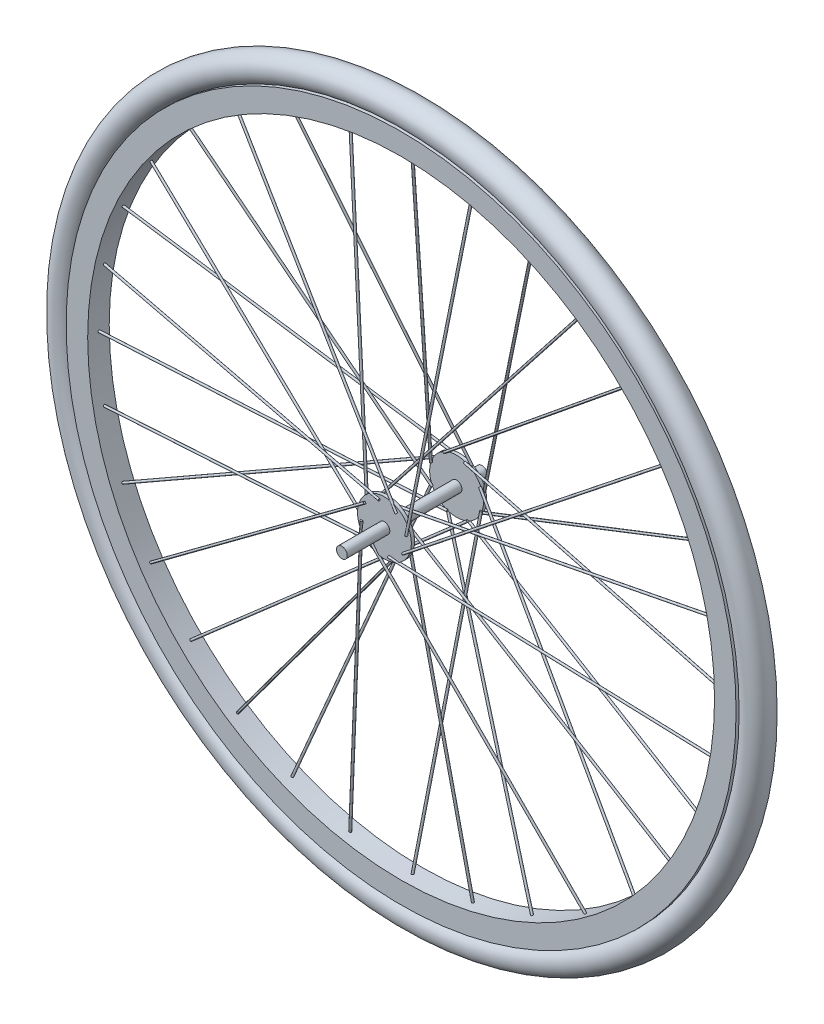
ISO-10303-21;
HEADER;
FILE_DESCRIPTION(('STEP AP214'),'2;1');
FILE_NAME('part.step','',(''),(''),'','','');
FILE_SCHEMA(('AUTOMOTIVE_DESIGN { 1 0 10303 214 1 1 1 1 }'));
ENDSEC;
DATA;
#1=APPLICATION_CONTEXT('core data for automotive mechanical design processes');
#2=APPLICATION_PROTOCOL_DEFINITION('international standard','automotive_design',2000,#1);
#3=PRODUCT_CONTEXT('',#1,'mechanical');
#4=PRODUCT('Part','Part','',(#3));
#5=PRODUCT_RELATED_PRODUCT_CATEGORY('part','',(#4));
#6=PRODUCT_DEFINITION_FORMATION('','',#4);
#7=PRODUCT_DEFINITION_CONTEXT('part definition',#1,'design');
#8=PRODUCT_DEFINITION('design','',#6,#7);
#9=PRODUCT_DEFINITION_SHAPE('','',#8);
#10=(LENGTH_UNIT() NAMED_UNIT(*) SI_UNIT(.MILLI.,.METRE.));
#11=(NAMED_UNIT(*) PLANE_ANGLE_UNIT() SI_UNIT($,.RADIAN.));
#12=(NAMED_UNIT(*) SI_UNIT($,.STERADIAN.) SOLID_ANGLE_UNIT());
#13=UNCERTAINTY_MEASURE_WITH_UNIT(LENGTH_MEASURE(1.E-05),#10,'distance_accuracy_value','');
#14=(GEOMETRIC_REPRESENTATION_CONTEXT(3) GLOBAL_UNCERTAINTY_ASSIGNED_CONTEXT((#13)) GLOBAL_UNIT_ASSIGNED_CONTEXT((#10,
#11,#12)) REPRESENTATION_CONTEXT('',''));
#15=CARTESIAN_POINT('',(0.,0.,0.));
#16=DIRECTION('',(0.,0.,1.));
#17=DIRECTION('',(1.,0.,0.));
#18=AXIS2_PLACEMENT_3D('',#15,#16,#17);
#19=CARTESIAN_POINT('',(-401.767253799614,56.9636479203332,-41.));
#20=DIRECTION('',(-0.0805053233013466,-0.986664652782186,0.141462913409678));
#21=DIRECTION('',(0.996687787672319,-0.0813231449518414,0.));
#22=AXIS2_PLACEMENT_3D('',#19,#20,#21);
#23=PLANE('',#22);
#24=CARTESIAN_POINT('',(-401.767253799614,56.9636479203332,-41.));
#25=DIRECTION('',(-0.0805053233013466,-0.986664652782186,0.141462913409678));
#26=DIRECTION('',(0.996687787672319,-0.0813231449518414,0.));
#27=AXIS2_PLACEMENT_3D('',#24,#25,#26);
#28=CIRCLE('',#27,1.);
#29=CARTESIAN_POINT('',(-400.770566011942,56.8823247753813,-41.));
#30=VERTEX_POINT('',#29);
#31=EDGE_CURVE('E114',#30,#30,#28,.T.);
#32=ORIENTED_EDGE('',*,*,#31,.F.);
#33=EDGE_LOOP('',(#32));
#34=FACE_BOUND('',#33,.T.);
#35=ADVANCED_FACE('F108',(#34),#23,.F.);
#36=CARTESIAN_POINT('',(-425.1,-229.,0.));
#37=DIRECTION('',(-0.0805053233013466,-0.986664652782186,0.141462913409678));
#38=DIRECTION('',(0.996687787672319,-0.0813231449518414,0.));
#39=AXIS2_PLACEMENT_3D('',#36,#37,#38);
#40=PLANE('',#39);
#41=CARTESIAN_POINT('',(-425.1,-229.,0.));
#42=DIRECTION('',(-0.0805053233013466,-0.986664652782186,0.141462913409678));
#43=DIRECTION('',(0.996687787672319,-0.0813231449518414,0.));
#44=AXIS2_PLACEMENT_3D('',#41,#42,#43);
#45=CIRCLE('',#44,1.);
#46=CARTESIAN_POINT('',(-424.103312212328,-229.081323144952,0.));
#47=VERTEX_POINT('',#46);
#48=EDGE_CURVE('E12',#47,#47,#45,.T.);
#49=ORIENTED_EDGE('',*,*,#48,.T.);
#50=EDGE_LOOP('',(#49));
#51=FACE_BOUND('',#50,.T.);
#52=ADVANCED_FACE('F123',(#51),#40,.T.);
#53=CARTESIAN_POINT('',(-401.767253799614,56.9636479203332,-41.));
#54=DIRECTION('',(-0.0805053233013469,-0.986664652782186,0.141462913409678));
#55=DIRECTION('',(0.996687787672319,-0.0813231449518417,0.));
#56=AXIS2_PLACEMENT_3D('',#53,#54,#55);
#57=CYLINDRICAL_SURFACE('',#56,1.);
#58=ORIENTED_EDGE('',*,*,#48,.F.);
#59=EDGE_LOOP('',(#58));
#60=FACE_BOUND('',#59,.T.);
#61=ORIENTED_EDGE('',*,*,#31,.T.);
#62=EDGE_LOOP('',(#61));
#63=FACE_BOUND('',#62,.T.);
#64=ADVANCED_FACE('F120',(#60,#63),#57,.T.);
#65=CLOSED_SHELL('',(#35,#52,#64));
#66=MANIFOLD_SOLID_BREP('B2',#65);
#67=CARTESIAN_POINT('',(-414.283815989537,42.8186978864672,-41.));
#68=DIRECTION('',(-0.754603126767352,-0.640751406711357,0.141462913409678));
#69=DIRECTION('',(0.647260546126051,-0.762268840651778,0.));
#70=AXIS2_PLACEMENT_3D('',#67,#68,#69);
#71=PLANE('',#70);
#72=CARTESIAN_POINT('',(-414.283815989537,42.8186978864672,-41.));
#73=DIRECTION('',(-0.754603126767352,-0.640751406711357,0.141462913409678));
#74=DIRECTION('',(0.647260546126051,-0.762268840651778,0.));
#75=AXIS2_PLACEMENT_3D('',#72,#73,#74);
#76=CIRCLE('',#75,1.);
#77=CARTESIAN_POINT('',(-413.636555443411,42.0564290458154,-41.));
#78=VERTEX_POINT('',#77);
#79=EDGE_CURVE('E168',#78,#78,#76,.T.);
#80=ORIENTED_EDGE('',*,*,#79,.F.);
#81=EDGE_LOOP('',(#80));
#82=FACE_BOUND('',#81,.T.);
#83=ADVANCED_FACE('F162',(#82),#71,.F.);
#84=CARTESIAN_POINT('',(-632.989393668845,-142.889393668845,0.));
#85=DIRECTION('',(-0.754603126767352,-0.640751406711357,0.141462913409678));
#86=DIRECTION('',(0.647260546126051,-0.762268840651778,0.));
#87=AXIS2_PLACEMENT_3D('',#84,#85,#86);
#88=PLANE('',#87);
#89=CARTESIAN_POINT('',(-632.989393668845,-142.889393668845,0.));
#90=DIRECTION('',(-0.754603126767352,-0.640751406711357,0.141462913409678));
#91=DIRECTION('',(0.647260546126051,-0.762268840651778,0.));
#92=AXIS2_PLACEMENT_3D('',#89,#90,#91);
#93=CIRCLE('',#92,1.);
#94=CARTESIAN_POINT('',(-632.342133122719,-143.651662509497,0.));
#95=VERTEX_POINT('',#94);
#96=EDGE_CURVE('E107',#95,#95,#93,.T.);
#97=ORIENTED_EDGE('',*,*,#96,.T.);
#98=EDGE_LOOP('',(#97));
#99=FACE_BOUND('',#98,.T.);
#100=ADVANCED_FACE('F177',(#99),#88,.T.);
#101=CARTESIAN_POINT('',(-414.283815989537,42.8186978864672,-41.));
#102=DIRECTION('',(-0.754603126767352,-0.640751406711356,0.141462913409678));
#103=DIRECTION('',(0.647260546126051,-0.762268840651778,0.));
#104=AXIS2_PLACEMENT_3D('',#101,#102,#103);
#105=CYLINDRICAL_SURFACE('',#104,1.);
#106=ORIENTED_EDGE('',*,*,#96,.F.);
#107=EDGE_LOOP('',(#106));
#108=FACE_BOUND('',#107,.T.);
#109=ORIENTED_EDGE('',*,*,#79,.T.);
#110=EDGE_LOOP('',(#109));
#111=FACE_BOUND('',#110,.T.);
#112=ADVANCED_FACE('F174',(#108,#111),#105,.T.);
#113=CLOSED_SHELL('',(#83,#100,#112));
#114=MANIFOLD_SOLID_BREP('B7',#113);
#115=CARTESIAN_POINT('',(-433.136352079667,41.6672537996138,-41.));
#116=DIRECTION('',(-0.986664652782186,0.0805053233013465,0.141462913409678));
#117=DIRECTION('',(-0.0813231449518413,-0.996687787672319,0.));
#118=AXIS2_PLACEMENT_3D('',#115,#116,#117);
#119=PLANE('',#118);
#120=CARTESIAN_POINT('',(-433.136352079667,41.6672537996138,-41.));
#121=DIRECTION('',(-0.986664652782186,0.0805053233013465,0.141462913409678));
#122=DIRECTION('',(-0.0813231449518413,-0.996687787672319,0.));
#123=AXIS2_PLACEMENT_3D('',#120,#121,#122);
#124=CIRCLE('',#123,1.);
#125=CARTESIAN_POINT('',(-433.217675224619,40.6705660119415,-41.));
#126=VERTEX_POINT('',#125);
#127=EDGE_CURVE('E222',#126,#126,#124,.T.);
#128=ORIENTED_EDGE('',*,*,#127,.F.);
#129=EDGE_LOOP('',(#128));
#130=FACE_BOUND('',#129,.T.);
#131=ADVANCED_FACE('F216',(#130),#119,.F.);
#132=CARTESIAN_POINT('',(-719.1,65.0000000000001,0.));
#133=DIRECTION('',(-0.986664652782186,0.0805053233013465,0.141462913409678));
#134=DIRECTION('',(-0.0813231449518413,-0.996687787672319,0.));
#135=AXIS2_PLACEMENT_3D('',#132,#133,#134);
#136=PLANE('',#135);
#137=CARTESIAN_POINT('',(-719.1,65.0000000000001,0.));
#138=DIRECTION('',(-0.986664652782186,0.0805053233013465,0.141462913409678));
#139=DIRECTION('',(-0.0813231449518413,-0.996687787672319,0.));
#140=AXIS2_PLACEMENT_3D('',#137,#138,#139);
#141=CIRCLE('',#140,1.);
#142=CARTESIAN_POINT('',(-719.181323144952,64.0033122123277,0.));
#143=VERTEX_POINT('',#142);
#144=EDGE_CURVE('E161',#143,#143,#141,.T.);
#145=ORIENTED_EDGE('',*,*,#144,.T.);
#146=EDGE_LOOP('',(#145));
#147=FACE_BOUND('',#146,.T.);
#148=ADVANCED_FACE('F231',(#147),#136,.T.);
#149=CARTESIAN_POINT('',(-433.136352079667,41.6672537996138,-41.));
#150=DIRECTION('',(-0.986664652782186,0.0805053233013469,0.141462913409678));
#151=DIRECTION('',(-0.0813231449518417,-0.996687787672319,0.));
#152=AXIS2_PLACEMENT_3D('',#149,#150,#151);
#153=CYLINDRICAL_SURFACE('',#152,1.);
#154=ORIENTED_EDGE('',*,*,#144,.F.);
#155=EDGE_LOOP('',(#154));
#156=FACE_BOUND('',#155,.T.);
#157=ORIENTED_EDGE('',*,*,#127,.T.);
#158=EDGE_LOOP('',(#157));
#159=FACE_BOUND('',#158,.T.);
#160=ADVANCED_FACE('F228',(#156,#159),#153,.T.);
#161=CLOSED_SHELL('',(#131,#148,#160));
#162=MANIFOLD_SOLID_BREP('B102',#161);
#163=CARTESIAN_POINT('',(-447.281302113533,54.1838159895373,-41.));
#164=DIRECTION('',(-0.640751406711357,0.754603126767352,0.141462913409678));
#165=DIRECTION('',(-0.762268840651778,-0.647260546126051,0.));
#166=AXIS2_PLACEMENT_3D('',#163,#164,#165);
#167=PLANE('',#166);
#168=CARTESIAN_POINT('',(-447.281302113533,54.1838159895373,-41.));
#169=DIRECTION('',(-0.640751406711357,0.754603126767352,0.141462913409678));
#170=DIRECTION('',(-0.762268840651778,-0.647260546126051,0.));
#171=AXIS2_PLACEMENT_3D('',#168,#169,#170);
#172=CIRCLE('',#171,1.);
#173=CARTESIAN_POINT('',(-448.043570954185,53.5365554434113,-41.));
#174=VERTEX_POINT('',#173);
#175=EDGE_CURVE('E276',#174,#174,#172,.T.);
#176=ORIENTED_EDGE('',*,*,#175,.F.);
#177=EDGE_LOOP('',(#176));
#178=FACE_BOUND('',#177,.T.);
#179=ADVANCED_FACE('F270',(#178),#167,.F.);
#180=CARTESIAN_POINT('',(-632.989393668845,272.889393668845,0.));
#181=DIRECTION('',(-0.640751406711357,0.754603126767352,0.141462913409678));
#182=DIRECTION('',(-0.762268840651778,-0.647260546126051,0.));
#183=AXIS2_PLACEMENT_3D('',#180,#181,#182);
#184=PLANE('',#183);
#185=CARTESIAN_POINT('',(-632.989393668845,272.889393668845,0.));
#186=DIRECTION('',(-0.640751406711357,0.754603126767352,0.141462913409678));
#187=DIRECTION('',(-0.762268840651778,-0.647260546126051,0.));
#188=AXIS2_PLACEMENT_3D('',#185,#186,#187);
#189=CIRCLE('',#188,1.);
#190=CARTESIAN_POINT('',(-633.751662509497,272.242133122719,0.));
#191=VERTEX_POINT('',#190);
#192=EDGE_CURVE('E215',#191,#191,#189,.T.);
#193=ORIENTED_EDGE('',*,*,#192,.T.);
#194=EDGE_LOOP('',(#193));
#195=FACE_BOUND('',#194,.T.);
#196=ADVANCED_FACE('F285',(#195),#184,.T.);
#197=CARTESIAN_POINT('',(-447.281302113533,54.1838159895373,-41.));
#198=DIRECTION('',(-0.640751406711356,0.754603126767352,0.141462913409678));
#199=DIRECTION('',(-0.762268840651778,-0.647260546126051,0.));
#200=AXIS2_PLACEMENT_3D('',#197,#198,#199);
#201=CYLINDRICAL_SURFACE('',#200,1.);
#202=ORIENTED_EDGE('',*,*,#192,.F.);
#203=EDGE_LOOP('',(#202));
#204=FACE_BOUND('',#203,.T.);
#205=ORIENTED_EDGE('',*,*,#175,.T.);
#206=EDGE_LOOP('',(#205));
#207=FACE_BOUND('',#206,.T.);
#208=ADVANCED_FACE('F282',(#204,#207),#201,.T.);
#209=CLOSED_SHELL('',(#179,#196,#208));
#210=MANIFOLD_SOLID_BREP('B156',#209);
#211=CARTESIAN_POINT('',(-448.432746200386,73.0363520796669,-41.));
#212=DIRECTION('',(0.0805053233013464,0.986664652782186,0.141462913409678));
#213=DIRECTION('',(-0.996687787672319,0.0813231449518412,0.));
#214=AXIS2_PLACEMENT_3D('',#211,#212,#213);
#215=PLANE('',#214);
#216=CARTESIAN_POINT('',(-448.432746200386,73.0363520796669,-41.));
#217=DIRECTION('',(0.0805053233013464,0.986664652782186,0.141462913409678));
#218=DIRECTION('',(-0.996687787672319,0.0813231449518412,0.));
#219=AXIS2_PLACEMENT_3D('',#216,#217,#218);
#220=CIRCLE('',#219,1.);
#221=CARTESIAN_POINT('',(-449.429433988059,73.1176752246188,-41.));
#222=VERTEX_POINT('',#221);
#223=EDGE_CURVE('E332',#222,#222,#220,.T.);
#224=ORIENTED_EDGE('',*,*,#223,.F.);
#225=EDGE_LOOP('',(#224));
#226=FACE_BOUND('',#225,.T.);
#227=ADVANCED_FACE('F326',(#226),#215,.F.);
#228=CARTESIAN_POINT('',(-425.1,359.,0.));
#229=DIRECTION('',(0.0805053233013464,0.986664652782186,0.141462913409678));
#230=DIRECTION('',(-0.996687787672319,0.0813231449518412,0.));
#231=AXIS2_PLACEMENT_3D('',#228,#229,#230);
#232=PLANE('',#231);
#233=CARTESIAN_POINT('',(-425.1,359.,0.));
#234=DIRECTION('',(0.0805053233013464,0.986664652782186,0.141462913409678));
#235=DIRECTION('',(-0.996687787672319,0.0813231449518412,0.));
#236=AXIS2_PLACEMENT_3D('',#233,#234,#235);
#237=CIRCLE('',#236,1.);
#238=CARTESIAN_POINT('',(-426.096687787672,359.081323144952,0.));
#239=VERTEX_POINT('',#238);
#240=EDGE_CURVE('E269',#239,#239,#237,.T.);
#241=ORIENTED_EDGE('',*,*,#240,.T.);
#242=EDGE_LOOP('',(#241));
#243=FACE_BOUND('',#242,.T.);
#244=ADVANCED_FACE('F341',(#243),#232,.T.);
#245=CARTESIAN_POINT('',(-448.432746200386,73.0363520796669,-41.));
#246=DIRECTION('',(0.0805053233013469,0.986664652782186,0.141462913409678));
#247=DIRECTION('',(-0.996687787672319,0.0813231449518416,0.));
#248=AXIS2_PLACEMENT_3D('',#245,#246,#247);
#249=CYLINDRICAL_SURFACE('',#248,1.);
#250=ORIENTED_EDGE('',*,*,#240,.F.);
#251=EDGE_LOOP('',(#250));
#252=FACE_BOUND('',#251,.T.);
#253=ORIENTED_EDGE('',*,*,#223,.T.);
#254=EDGE_LOOP('',(#253));
#255=FACE_BOUND('',#254,.T.);
#256=ADVANCED_FACE('F338',(#252,#255),#249,.T.);
#257=CLOSED_SHELL('',(#227,#244,#256));
#258=MANIFOLD_SOLID_BREP('B210',#257);
#259=CARTESIAN_POINT('',(-435.916184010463,87.1813021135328,-41.));
#260=DIRECTION('',(0.754603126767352,0.640751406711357,0.141462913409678));
#261=DIRECTION('',(-0.647260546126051,0.762268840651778,0.));
#262=AXIS2_PLACEMENT_3D('',#259,#260,#261);
#263=PLANE('',#262);
#264=CARTESIAN_POINT('',(-435.916184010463,87.1813021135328,-41.));
#265=DIRECTION('',(0.754603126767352,0.640751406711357,0.141462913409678));
#266=DIRECTION('',(-0.647260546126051,0.762268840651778,0.));
#267=AXIS2_PLACEMENT_3D('',#264,#265,#266);
#268=CIRCLE('',#267,1.);
#269=CARTESIAN_POINT('',(-436.563444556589,87.9435709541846,-41.));
#270=VERTEX_POINT('',#269);
#271=EDGE_CURVE('E392',#270,#270,#268,.T.);
#272=ORIENTED_EDGE('',*,*,#271,.F.);
#273=EDGE_LOOP('',(#272));
#274=FACE_BOUND('',#273,.T.);
#275=ADVANCED_FACE('F386',(#274),#263,.F.);
#276=CARTESIAN_POINT('',(-217.210606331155,272.889393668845,0.));
#277=DIRECTION('',(0.754603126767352,0.640751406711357,0.141462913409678));
#278=DIRECTION('',(-0.647260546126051,0.762268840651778,0.));
#279=AXIS2_PLACEMENT_3D('',#276,#277,#278);
#280=PLANE('',#279);
#281=CARTESIAN_POINT('',(-217.210606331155,272.889393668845,0.));
#282=DIRECTION('',(0.754603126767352,0.640751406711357,0.141462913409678));
#283=DIRECTION('',(-0.647260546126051,0.762268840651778,0.));
#284=AXIS2_PLACEMENT_3D('',#281,#282,#283);
#285=CIRCLE('',#284,1.);
#286=CARTESIAN_POINT('',(-217.857866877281,273.651662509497,0.));
#287=VERTEX_POINT('',#286);
#288=EDGE_CURVE('E325',#287,#287,#285,.T.);
#289=ORIENTED_EDGE('',*,*,#288,.T.);
#290=EDGE_LOOP('',(#289));
#291=FACE_BOUND('',#290,.T.);
#292=ADVANCED_FACE('F401',(#291),#280,.T.);
#293=CARTESIAN_POINT('',(-435.916184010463,87.1813021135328,-41.));
#294=DIRECTION('',(0.754603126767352,0.640751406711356,0.141462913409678));
#295=DIRECTION('',(-0.647260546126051,0.762268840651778,0.));
#296=AXIS2_PLACEMENT_3D('',#293,#294,#295);
#297=CYLINDRICAL_SURFACE('',#296,1.);
#298=ORIENTED_EDGE('',*,*,#288,.F.);
#299=EDGE_LOOP('',(#298));
#300=FACE_BOUND('',#299,.T.);
#301=ORIENTED_EDGE('',*,*,#271,.T.);
#302=EDGE_LOOP('',(#301));
#303=FACE_BOUND('',#302,.T.);
#304=ADVANCED_FACE('F398',(#300,#303),#297,.T.);
#305=CLOSED_SHELL('',(#275,#292,#304));
#306=MANIFOLD_SOLID_BREP('B264',#305);
#307=CARTESIAN_POINT('',(-417.063647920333,88.3327462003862,-41.));
#308=DIRECTION('',(0.986664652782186,-0.0805053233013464,0.141462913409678));
#309=DIRECTION('',(0.0813231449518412,0.996687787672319,0.));
#310=AXIS2_PLACEMENT_3D('',#307,#308,#309);
#311=PLANE('',#310);
#312=CARTESIAN_POINT('',(-417.063647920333,88.3327462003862,-41.));
#313=DIRECTION('',(0.986664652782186,-0.0805053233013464,0.141462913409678));
#314=DIRECTION('',(0.0813231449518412,0.996687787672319,0.));
#315=AXIS2_PLACEMENT_3D('',#312,#313,#314);
#316=CIRCLE('',#315,1.);
#317=CARTESIAN_POINT('',(-416.982324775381,89.3294339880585,-41.));
#318=VERTEX_POINT('',#317);
#319=EDGE_CURVE('E446',#318,#318,#316,.T.);
#320=ORIENTED_EDGE('',*,*,#319,.F.);
#321=EDGE_LOOP('',(#320));
#322=FACE_BOUND('',#321,.T.);
#323=ADVANCED_FACE('F440',(#322),#311,.F.);
#324=CARTESIAN_POINT('',(-131.1,65.,0.));
#325=DIRECTION('',(0.986664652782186,-0.0805053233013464,0.141462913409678));
#326=DIRECTION('',(0.0813231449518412,0.996687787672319,0.));
#327=AXIS2_PLACEMENT_3D('',#324,#325,#326);
#328=PLANE('',#327);
#329=CARTESIAN_POINT('',(-131.1,65.,0.));
#330=DIRECTION('',(0.986664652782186,-0.0805053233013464,0.141462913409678));
#331=DIRECTION('',(0.0813231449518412,0.996687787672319,0.));
#332=AXIS2_PLACEMENT_3D('',#329,#330,#331);
#333=CIRCLE('',#332,1.);
#334=CARTESIAN_POINT('',(-131.018676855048,65.9966877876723,0.));
#335=VERTEX_POINT('',#334);
#336=EDGE_CURVE('E385',#335,#335,#333,.T.);
#337=ORIENTED_EDGE('',*,*,#336,.T.);
#338=EDGE_LOOP('',(#337));
#339=FACE_BOUND('',#338,.T.);
#340=ADVANCED_FACE('F455',(#339),#328,.T.);
#341=CARTESIAN_POINT('',(-417.063647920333,88.3327462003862,-41.));
#342=DIRECTION('',(0.986664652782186,-0.0805053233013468,0.141462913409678));
#343=DIRECTION('',(0.0813231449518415,0.996687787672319,0.));
#344=AXIS2_PLACEMENT_3D('',#341,#342,#343);
#345=CYLINDRICAL_SURFACE('',#344,1.);
#346=ORIENTED_EDGE('',*,*,#336,.F.);
#347=EDGE_LOOP('',(#346));
#348=FACE_BOUND('',#347,.T.);
#349=ORIENTED_EDGE('',*,*,#319,.T.);
#350=EDGE_LOOP('',(#349));
#351=FACE_BOUND('',#350,.T.);
#352=ADVANCED_FACE('F452',(#348,#351),#345,.T.);
#353=CLOSED_SHELL('',(#323,#340,#352));
#354=MANIFOLD_SOLID_BREP('B320',#353);
#355=CARTESIAN_POINT('',(-409.90781119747,50.1507575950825,-45.));
#356=DIRECTION('',(0.884758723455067,0.439425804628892,0.155264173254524));
#357=DIRECTION('',(-0.444820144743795,0.895619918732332,0.));
#358=AXIS2_PLACEMENT_3D('',#355,#356,#357);
#359=PLANE('',#358);
#360=CARTESIAN_POINT('',(-409.90781119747,50.1507575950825,-45.));
#361=DIRECTION('',(0.884758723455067,0.439425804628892,0.155264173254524));
#362=DIRECTION('',(-0.444820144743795,0.895619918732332,0.));
#363=AXIS2_PLACEMENT_3D('',#360,#361,#362);
#364=CIRCLE('',#363,1.00000000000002);
#365=CARTESIAN_POINT('',(-410.352631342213,51.0463775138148,-45.));
#366=VERTEX_POINT('',#365);
#367=EDGE_CURVE('E500',#366,#366,#364,.T.);
#368=ORIENTED_EDGE('',*,*,#367,.F.);
#369=EDGE_LOOP('',(#368));
#370=FACE_BOUND('',#369,.T.);
#371=ADVANCED_FACE('F494',(#370),#359,.F.);
#372=CARTESIAN_POINT('',(-153.479417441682,177.508929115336,0.));
#373=DIRECTION('',(0.884758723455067,0.439425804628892,0.155264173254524));
#374=DIRECTION('',(-0.444820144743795,0.895619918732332,0.));
#375=AXIS2_PLACEMENT_3D('',#372,#373,#374);
#376=PLANE('',#375);
#377=CARTESIAN_POINT('',(-153.479417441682,177.508929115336,0.));
#378=DIRECTION('',(0.884758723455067,0.439425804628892,0.155264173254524));
#379=DIRECTION('',(-0.444820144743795,0.895619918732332,0.));
#380=AXIS2_PLACEMENT_3D('',#377,#378,#379);
#381=CIRCLE('',#380,1.00000000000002);
#382=CARTESIAN_POINT('',(-153.924237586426,178.404549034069,0.));
#383=VERTEX_POINT('',#382);
#384=EDGE_CURVE('E439',#383,#383,#381,.T.);
#385=ORIENTED_EDGE('',*,*,#384,.T.);
#386=EDGE_LOOP('',(#385));
#387=FACE_BOUND('',#386,.T.);
#388=ADVANCED_FACE('F509',(#387),#376,.T.);
#389=CARTESIAN_POINT('',(-409.90781119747,50.1507575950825,-45.));
#390=DIRECTION('',(0.884758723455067,0.439425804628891,0.155264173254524));
#391=DIRECTION('',(-0.444820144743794,0.895619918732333,0.));
#392=AXIS2_PLACEMENT_3D('',#389,#390,#391);
#393=CYLINDRICAL_SURFACE('',#392,1.00000000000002);
#394=ORIENTED_EDGE('',*,*,#384,.F.);
#395=EDGE_LOOP('',(#394));
#396=FACE_BOUND('',#395,.T.);
#397=ORIENTED_EDGE('',*,*,#367,.T.);
#398=EDGE_LOOP('',(#397));
#399=FACE_BOUND('',#398,.T.);
#400=ADVANCED_FACE('F506',(#396,#399),#393,.T.);
#401=CLOSED_SHELL('',(#371,#388,#400));
#402=MANIFOLD_SOLID_BREP('B380',#401);
#403=CARTESIAN_POINT('',(-424.857500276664,43.7575002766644,-45.));
#404=DIRECTION('',(0.936339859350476,-0.314897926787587,0.155264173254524));
#405=DIRECTION('',(0.318763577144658,0.947834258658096,0.));
#406=AXIS2_PLACEMENT_3D('',#403,#404,#405);
#407=PLANE('',#406);
#408=CARTESIAN_POINT('',(-424.857500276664,43.7575002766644,-45.));
#409=DIRECTION('',(0.936339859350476,-0.314897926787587,0.155264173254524));
#410=DIRECTION('',(0.318763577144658,0.947834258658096,0.));
#411=AXIS2_PLACEMENT_3D('',#408,#409,#410);
#412=CIRCLE('',#411,1.00000000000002);
#413=CARTESIAN_POINT('',(-424.53873669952,44.7053345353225,-45.));
#414=VERTEX_POINT('',#413);
#415=EDGE_CURVE('E554',#414,#414,#412,.T.);
#416=ORIENTED_EDGE('',*,*,#415,.F.);
#417=EDGE_LOOP('',(#416));
#418=FACE_BOUND('',#417,.T.);
#419=ADVANCED_FACE('F548',(#418),#407,.F.);
#420=CARTESIAN_POINT('',(-153.479417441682,-47.5089291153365,0.));
#421=DIRECTION('',(0.936339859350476,-0.314897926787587,0.155264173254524));
#422=DIRECTION('',(0.318763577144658,0.947834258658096,0.));
#423=AXIS2_PLACEMENT_3D('',#420,#421,#422);
#424=PLANE('',#423);
#425=CARTESIAN_POINT('',(-153.479417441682,-47.5089291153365,0.));
#426=DIRECTION('',(0.936339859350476,-0.314897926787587,0.155264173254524));
#427=DIRECTION('',(0.318763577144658,0.947834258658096,0.));
#428=AXIS2_PLACEMENT_3D('',#425,#426,#427);
#429=CIRCLE('',#428,1.00000000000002);
#430=CARTESIAN_POINT('',(-153.160653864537,-46.5610948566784,0.));
#431=VERTEX_POINT('',#430);
#432=EDGE_CURVE('E493',#431,#431,#429,.T.);
#433=ORIENTED_EDGE('',*,*,#432,.T.);
#434=EDGE_LOOP('',(#433));
#435=FACE_BOUND('',#434,.T.);
#436=ADVANCED_FACE('F563',(#435),#424,.T.);
#437=CARTESIAN_POINT('',(-424.857500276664,43.7575002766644,-45.));
#438=DIRECTION('',(0.936339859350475,-0.314897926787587,0.155264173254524));
#439=DIRECTION('',(0.318763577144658,0.947834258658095,0.));
#440=AXIS2_PLACEMENT_3D('',#437,#438,#439);
#441=CYLINDRICAL_SURFACE('',#440,1.00000000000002);
#442=CARTESIAN_POINT('',(-153.160653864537,-46.5610948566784,0.));
#443=CARTESIAN_POINT('',(-155.987508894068,-45.610402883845,-0.468750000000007));
#444=CARTESIAN_POINT('',(-158.814363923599,-44.6597109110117,-0.937500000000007));
#445=CARTESIAN_POINT('',(-164.468073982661,-42.758326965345,-1.87500000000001));
#446=CARTESIAN_POINT('',(-167.294929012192,-41.8076349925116,-2.34375));
#447=CARTESIAN_POINT('',(-172.948639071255,-39.906251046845,-3.28125));
#448=CARTESIAN_POINT('',(-175.775494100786,-38.9555590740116,-3.75));
#449=CARTESIAN_POINT('',(-181.429204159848,-37.0541751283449,-4.6875));
#450=CARTESIAN_POINT('',(-184.256059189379,-36.1034831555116,-5.15625));
#451=CARTESIAN_POINT('',(-189.909769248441,-34.2020992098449,-6.09375000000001));
#452=CARTESIAN_POINT('',(-192.736624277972,-33.2514072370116,-6.5625));
#453=CARTESIAN_POINT('',(-198.390334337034,-31.3500232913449,-7.5));
#454=CARTESIAN_POINT('',(-201.217189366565,-30.3993313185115,-7.96875));
#455=CARTESIAN_POINT('',(-206.870899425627,-28.4979473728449,-8.90625));
#456=CARTESIAN_POINT('',(-209.697754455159,-27.5472554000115,-9.375));
#457=CARTESIAN_POINT('',(-215.351464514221,-25.6458714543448,-10.3125));
#458=CARTESIAN_POINT('',(-218.178319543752,-24.6951794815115,-10.78125));
#459=CARTESIAN_POINT('',(-223.832029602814,-22.7937955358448,-11.71875));
#460=CARTESIAN_POINT('',(-226.658884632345,-21.8431035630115,-12.1875));
#461=CARTESIAN_POINT('',(-232.312594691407,-19.9417196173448,-13.125));
#462=CARTESIAN_POINT('',(-235.139449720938,-18.9910276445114,-13.59375));
#463=CARTESIAN_POINT('',(-240.79315978,-17.0896436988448,-14.53125));
#464=CARTESIAN_POINT('',(-243.620014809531,-16.1389517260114,-15.));
#465=CARTESIAN_POINT('',(-249.273724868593,-14.2375677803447,-15.9375));
#466=CARTESIAN_POINT('',(-252.100579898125,-13.2868758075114,-16.40625));
#467=CARTESIAN_POINT('',(-257.754289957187,-11.3854918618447,-17.34375));
#468=CARTESIAN_POINT('',(-260.581144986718,-10.4347998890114,-17.8125));
#469=CARTESIAN_POINT('',(-266.23485504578,-8.53341594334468,-18.75));
#470=CARTESIAN_POINT('',(-269.061710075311,-7.58272397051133,-19.21875));
#471=CARTESIAN_POINT('',(-274.715420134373,-5.68134002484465,-20.15625));
#472=CARTESIAN_POINT('',(-277.542275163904,-4.73064805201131,-20.625));
#473=CARTESIAN_POINT('',(-283.195985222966,-2.82926410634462,-21.5625));
#474=CARTESIAN_POINT('',(-286.022840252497,-1.87857213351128,-22.03125));
#475=CARTESIAN_POINT('',(-291.67655031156,0.0228118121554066,-22.96875));
#476=CARTESIAN_POINT('',(-294.503405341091,0.973503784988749,-23.4375));
#477=CARTESIAN_POINT('',(-300.157115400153,2.87488773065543,-24.375));
#478=CARTESIAN_POINT('',(-302.983970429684,3.82557970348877,-24.84375));
#479=CARTESIAN_POINT('',(-308.637680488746,5.72696364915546,-25.78125));
#480=CARTESIAN_POINT('',(-311.464535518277,6.6776556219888,-26.25));
#481=CARTESIAN_POINT('',(-317.118245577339,8.57903956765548,-27.1875));
#482=CARTESIAN_POINT('',(-319.94510060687,9.52973154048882,-27.65625));
#483=CARTESIAN_POINT('',(-325.598810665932,11.4311154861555,-28.59375));
#484=CARTESIAN_POINT('',(-328.425665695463,12.3818074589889,-29.0625));
#485=CARTESIAN_POINT('',(-334.079375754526,14.2831914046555,-30.));
#486=CARTESIAN_POINT('',(-336.906230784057,15.2338833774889,-30.46875));
#487=CARTESIAN_POINT('',(-342.559940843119,17.1352673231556,-31.40625));
#488=CARTESIAN_POINT('',(-345.38679587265,18.0859592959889,-31.875));
#489=CARTESIAN_POINT('',(-351.040505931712,19.9873432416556,-32.8125));
#490=CARTESIAN_POINT('',(-353.867360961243,20.9380352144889,-33.28125));
#491=CARTESIAN_POINT('',(-359.521071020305,22.8394191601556,-34.21875));
#492=CARTESIAN_POINT('',(-362.347926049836,23.790111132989,-34.6875));
#493=CARTESIAN_POINT('',(-368.001636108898,25.6914950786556,-35.625));
#494=CARTESIAN_POINT('',(-370.82849113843,26.642187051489,-36.09375));
#495=CARTESIAN_POINT('',(-376.482201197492,28.5435709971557,-37.03125));
#496=CARTESIAN_POINT('',(-379.309056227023,29.494262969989,-37.5));
#497=CARTESIAN_POINT('',(-384.962766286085,31.3956469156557,-38.4375));
#498=CARTESIAN_POINT('',(-387.789621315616,32.346338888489,-38.90625));
#499=CARTESIAN_POINT('',(-393.443331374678,34.2477228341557,-39.84375));
#500=CARTESIAN_POINT('',(-396.270186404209,35.1984148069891,-40.3125));
#501=CARTESIAN_POINT('',(-401.923896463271,37.0997987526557,-41.25));
#502=CARTESIAN_POINT('',(-404.750751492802,38.0504907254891,-41.71875));
#503=CARTESIAN_POINT('',(-410.404461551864,39.9518746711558,-42.65625));
#504=CARTESIAN_POINT('',(-413.231316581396,40.9025666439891,-43.125));
#505=CARTESIAN_POINT('',(-418.885026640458,42.8039505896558,-44.0625));
#506=CARTESIAN_POINT('',(-421.711881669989,43.7546425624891,-44.53125));
#507=CARTESIAN_POINT('',(-424.53873669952,44.7053345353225,-45.));
#508=B_SPLINE_CURVE_WITH_KNOTS('',3,(#442,#443,#444,#445,#446,#447,#448,#449,#450,#451,#452,
#453,#454,#455,#456,#457,#458,#459,#460,#461,#462,#463,#464,#465,#466,#467,#468,#469,#470,#471,
#472,#473,#474,#475,#476,#477,#478,#479,#480,#481,#482,#483,#484,#485,#486,#487,#488,#489,#490,
#491,#492,#493,#494,#495,#496,#497,#498,#499,#500,#501,#502,#503,#504,#505,#506,#507),
.UNSPECIFIED.,.F.,.F.,(4,2,2,2,2,2,2,2,2,2,2,2,2,2,2,2,2,2,2,2,2,2,2,2,2,2,2,2,2,2,2,2,4),(0.,
9.05714415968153,18.1142883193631,27.1714324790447,36.2285766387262,45.2857207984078,
54.3428649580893,63.4000091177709,72.4571532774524,81.514297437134,90.5714415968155,
99.6285857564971,108.685729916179,117.74287407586,126.800018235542,135.857162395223,
144.914306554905,153.971450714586,163.028594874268,172.08573903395,181.142883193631,
190.200027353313,199.257171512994,208.314315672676,217.371459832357,226.428603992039,
235.485748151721,244.542892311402,253.600036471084,262.657180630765,271.714324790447,
280.771468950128,289.82861310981),.UNSPECIFIED.);
#509=EDGE_CURVE('BSEAM560',#431,#414,#508,.T.);
#510=ORIENTED_EDGE('',*,*,#432,.F.);
#511=ORIENTED_EDGE('',*,*,#415,.T.);
#512=ORIENTED_EDGE('',*,*,#509,.T.);
#513=ORIENTED_EDGE('',*,*,#509,.F.);
#514=EDGE_LOOP('',(#510,#512,#511,#513));
#515=FACE_BOUND('',#514,.T.);
#516=ADVANCED_FACE('F560',(#515),#441,.T.);
#517=CLOSED_SHELL('',(#419,#436,#516));
#518=MANIFOLD_SOLID_BREP('B434',#517);
#519=CARTESIAN_POINT('',(-439.949242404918,49.8078111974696,-45.));
#520=DIRECTION('',(0.439425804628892,-0.884758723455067,0.155264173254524));
#521=DIRECTION('',(0.895619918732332,0.444820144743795,0.));
#522=AXIS2_PLACEMENT_3D('',#519,#520,#521);
#523=PLANE('',#522);
#524=CARTESIAN_POINT('',(-439.949242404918,49.8078111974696,-45.));
#525=DIRECTION('',(0.439425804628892,-0.884758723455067,0.155264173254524));
#526=DIRECTION('',(0.895619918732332,0.444820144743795,0.));
#527=AXIS2_PLACEMENT_3D('',#524,#525,#526);
#528=CIRCLE('',#527,1.00000000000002);
#529=CARTESIAN_POINT('',(-439.053622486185,50.2526313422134,-45.));
#530=VERTEX_POINT('',#529);
#531=EDGE_CURVE('E608',#530,#530,#528,.T.);
#532=ORIENTED_EDGE('',*,*,#531,.F.);
#533=EDGE_LOOP('',(#532));
#534=FACE_BOUND('',#533,.T.);
#535=ADVANCED_FACE('F602',(#534),#523,.F.);
#536=CARTESIAN_POINT('',(-312.591070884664,-206.620582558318,0.));
#537=DIRECTION('',(0.439425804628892,-0.884758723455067,0.155264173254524));
#538=DIRECTION('',(0.895619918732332,0.444820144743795,0.));
#539=AXIS2_PLACEMENT_3D('',#536,#537,#538);
#540=PLANE('',#539);
#541=CARTESIAN_POINT('',(-312.591070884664,-206.620582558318,0.));
#542=DIRECTION('',(0.439425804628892,-0.884758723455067,0.155264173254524));
#543=DIRECTION('',(0.895619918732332,0.444820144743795,0.));
#544=AXIS2_PLACEMENT_3D('',#541,#542,#543);
#545=CIRCLE('',#544,1.00000000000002);
#546=CARTESIAN_POINT('',(-311.695450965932,-206.175762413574,0.));
#547=VERTEX_POINT('',#546);
#548=EDGE_CURVE('E547',#547,#547,#545,.T.);
#549=ORIENTED_EDGE('',*,*,#548,.T.);
#550=EDGE_LOOP('',(#549));
#551=FACE_BOUND('',#550,.T.);
#552=ADVANCED_FACE('F617',(#551),#540,.T.);
#553=CARTESIAN_POINT('',(-439.949242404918,49.8078111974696,-45.));
#554=DIRECTION('',(0.439425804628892,-0.884758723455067,0.155264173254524));
#555=DIRECTION('',(0.895619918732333,0.444820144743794,0.));
#556=AXIS2_PLACEMENT_3D('',#553,#554,#555);
#557=CYLINDRICAL_SURFACE('',#556,1.00000000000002);
#558=ORIENTED_EDGE('',*,*,#548,.F.);
#559=EDGE_LOOP('',(#558));
#560=FACE_BOUND('',#559,.T.);
#561=ORIENTED_EDGE('',*,*,#531,.T.);
#562=EDGE_LOOP('',(#561));
#563=FACE_BOUND('',#562,.T.);
#564=ADVANCED_FACE('F614',(#560,#563),#557,.T.);
#565=CLOSED_SHELL('',(#535,#552,#564));
#566=MANIFOLD_SOLID_BREP('B488',#565);
#567=CARTESIAN_POINT('',(-446.342499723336,64.7575002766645,-45.));
#568=DIRECTION('',(-0.314897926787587,-0.936339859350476,0.155264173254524));
#569=DIRECTION('',(0.947834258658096,-0.318763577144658,0.));
#570=AXIS2_PLACEMENT_3D('',#567,#568,#569);
#571=PLANE('',#570);
#572=CARTESIAN_POINT('',(-446.342499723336,64.7575002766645,-45.));
#573=DIRECTION('',(-0.314897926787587,-0.936339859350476,0.155264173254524));
#574=DIRECTION('',(0.947834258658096,-0.318763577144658,0.));
#575=AXIS2_PLACEMENT_3D('',#572,#573,#574);
#576=CIRCLE('',#575,1.00000000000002);
#577=CARTESIAN_POINT('',(-445.394665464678,64.4387366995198,-45.));
#578=VERTEX_POINT('',#577);
#579=EDGE_CURVE('E662',#578,#578,#576,.T.);
#580=ORIENTED_EDGE('',*,*,#579,.F.);
#581=EDGE_LOOP('',(#580));
#582=FACE_BOUND('',#581,.T.);
#583=ADVANCED_FACE('F656',(#582),#571,.F.);
#584=CARTESIAN_POINT('',(-537.608929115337,-206.620582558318,0.));
#585=DIRECTION('',(-0.314897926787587,-0.936339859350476,0.155264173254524));
#586=DIRECTION('',(0.947834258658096,-0.318763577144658,0.));
#587=AXIS2_PLACEMENT_3D('',#584,#585,#586);
#588=PLANE('',#587);
#589=CARTESIAN_POINT('',(-537.608929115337,-206.620582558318,0.));
#590=DIRECTION('',(-0.314897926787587,-0.936339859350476,0.155264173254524));
#591=DIRECTION('',(0.947834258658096,-0.318763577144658,0.));
#592=AXIS2_PLACEMENT_3D('',#589,#590,#591);
#593=CIRCLE('',#592,1.00000000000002);
#594=CARTESIAN_POINT('',(-536.661094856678,-206.939346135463,0.));
#595=VERTEX_POINT('',#594);
#596=EDGE_CURVE('E601',#595,#595,#593,.T.);
#597=ORIENTED_EDGE('',*,*,#596,.T.);
#598=EDGE_LOOP('',(#597));
#599=FACE_BOUND('',#598,.T.);
#600=ADVANCED_FACE('F671',(#599),#588,.T.);
#601=CARTESIAN_POINT('',(-446.342499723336,64.7575002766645,-45.));
#602=DIRECTION('',(-0.314897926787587,-0.936339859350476,0.155264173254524));
#603=DIRECTION('',(0.947834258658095,-0.318763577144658,0.));
#604=AXIS2_PLACEMENT_3D('',#601,#602,#603);
#605=CYLINDRICAL_SURFACE('',#604,1.00000000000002);
#606=ORIENTED_EDGE('',*,*,#596,.F.);
#607=EDGE_LOOP('',(#606));
#608=FACE_BOUND('',#607,.T.);
#609=ORIENTED_EDGE('',*,*,#579,.T.);
#610=EDGE_LOOP('',(#609));
#611=FACE_BOUND('',#610,.T.);
#612=ADVANCED_FACE('F668',(#608,#611),#605,.T.);
#613=CLOSED_SHELL('',(#583,#600,#612));
#614=MANIFOLD_SOLID_BREP('B542',#613);
#615=CARTESIAN_POINT('',(-440.29218880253,79.8492424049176,-45.));
#616=DIRECTION('',(-0.884758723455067,-0.439425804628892,0.155264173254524));
#617=DIRECTION('',(0.444820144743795,-0.895619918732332,0.));
#618=AXIS2_PLACEMENT_3D('',#615,#616,#617);
#619=PLANE('',#618);
#620=CARTESIAN_POINT('',(-440.29218880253,79.8492424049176,-45.));
#621=DIRECTION('',(-0.884758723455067,-0.439425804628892,0.155264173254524));
#622=DIRECTION('',(0.444820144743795,-0.895619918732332,0.));
#623=AXIS2_PLACEMENT_3D('',#620,#621,#622);
#624=CIRCLE('',#623,1.00000000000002);
#625=CARTESIAN_POINT('',(-439.847368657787,78.9536224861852,-45.));
#626=VERTEX_POINT('',#625);
#627=EDGE_CURVE('E716',#626,#626,#624,.T.);
#628=ORIENTED_EDGE('',*,*,#627,.F.);
#629=EDGE_LOOP('',(#628));
#630=FACE_BOUND('',#629,.T.);
#631=ADVANCED_FACE('F710',(#630),#619,.F.);
#632=CARTESIAN_POINT('',(-696.720582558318,-47.5089291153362,0.));
#633=DIRECTION('',(-0.884758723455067,-0.439425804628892,0.155264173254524));
#634=DIRECTION('',(0.444820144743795,-0.895619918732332,0.));
#635=AXIS2_PLACEMENT_3D('',#632,#633,#634);
#636=PLANE('',#635);
#637=CARTESIAN_POINT('',(-696.720582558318,-47.5089291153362,0.));
#638=DIRECTION('',(-0.884758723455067,-0.439425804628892,0.155264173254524));
#639=DIRECTION('',(0.444820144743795,-0.895619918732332,0.));
#640=AXIS2_PLACEMENT_3D('',#637,#638,#639);
#641=CIRCLE('',#640,1.00000000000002);
#642=CARTESIAN_POINT('',(-696.275762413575,-48.4045490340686,0.));
#643=VERTEX_POINT('',#642);
#644=EDGE_CURVE('E655',#643,#643,#641,.T.);
#645=ORIENTED_EDGE('',*,*,#644,.T.);
#646=EDGE_LOOP('',(#645));
#647=FACE_BOUND('',#646,.T.);
#648=ADVANCED_FACE('F725',(#647),#636,.T.);
#649=CARTESIAN_POINT('',(-440.29218880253,79.8492424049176,-45.));
#650=DIRECTION('',(-0.884758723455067,-0.439425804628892,0.155264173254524));
#651=DIRECTION('',(0.444820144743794,-0.895619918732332,0.));
#652=AXIS2_PLACEMENT_3D('',#649,#650,#651);
#653=CYLINDRICAL_SURFACE('',#652,1.00000000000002);
#654=ORIENTED_EDGE('',*,*,#644,.F.);
#655=EDGE_LOOP('',(#654));
#656=FACE_BOUND('',#655,.T.);
#657=ORIENTED_EDGE('',*,*,#627,.T.);
#658=EDGE_LOOP('',(#657));
#659=FACE_BOUND('',#658,.T.);
#660=ADVANCED_FACE('F722',(#656,#659),#653,.T.);
#661=CLOSED_SHELL('',(#631,#648,#660));
#662=MANIFOLD_SOLID_BREP('B596',#661);
#663=CARTESIAN_POINT('',(-425.342499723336,86.2424997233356,-45.));
#664=DIRECTION('',(-0.936339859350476,0.314897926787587,0.155264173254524));
#665=DIRECTION('',(-0.318763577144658,-0.947834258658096,0.));
#666=AXIS2_PLACEMENT_3D('',#663,#664,#665);
#667=PLANE('',#666);
#668=CARTESIAN_POINT('',(-425.342499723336,86.2424997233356,-45.));
#669=DIRECTION('',(-0.936339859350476,0.314897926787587,0.155264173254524));
#670=DIRECTION('',(-0.318763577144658,-0.947834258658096,0.));
#671=AXIS2_PLACEMENT_3D('',#668,#669,#670);
#672=CIRCLE('',#671,1.00000000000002);
#673=CARTESIAN_POINT('',(-425.66126330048,85.2946654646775,-45.));
#674=VERTEX_POINT('',#673);
#675=EDGE_CURVE('E770',#674,#674,#672,.T.);
#676=ORIENTED_EDGE('',*,*,#675,.F.);
#677=EDGE_LOOP('',(#676));
#678=FACE_BOUND('',#677,.T.);
#679=ADVANCED_FACE('F764',(#678),#667,.F.);
#680=CARTESIAN_POINT('',(-696.720582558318,177.508929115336,0.));
#681=DIRECTION('',(-0.936339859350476,0.314897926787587,0.155264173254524));
#682=DIRECTION('',(-0.318763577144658,-0.947834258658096,0.));
#683=AXIS2_PLACEMENT_3D('',#680,#681,#682);
#684=PLANE('',#683);
#685=CARTESIAN_POINT('',(-696.720582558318,177.508929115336,0.));
#686=DIRECTION('',(-0.936339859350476,0.314897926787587,0.155264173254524));
#687=DIRECTION('',(-0.318763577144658,-0.947834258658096,0.));
#688=AXIS2_PLACEMENT_3D('',#685,#686,#687);
#689=CIRCLE('',#688,1.00000000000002);
#690=CARTESIAN_POINT('',(-697.039346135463,176.561094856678,0.));
#691=VERTEX_POINT('',#690);
#692=EDGE_CURVE('E709',#691,#691,#689,.T.);
#693=ORIENTED_EDGE('',*,*,#692,.T.);
#694=EDGE_LOOP('',(#693));
#695=FACE_BOUND('',#694,.T.);
#696=ADVANCED_FACE('F779',(#695),#684,.T.);
#697=CARTESIAN_POINT('',(-425.342499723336,86.2424997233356,-45.));
#698=DIRECTION('',(-0.936339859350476,0.314897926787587,0.155264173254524));
#699=DIRECTION('',(-0.318763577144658,-0.947834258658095,0.));
#700=AXIS2_PLACEMENT_3D('',#697,#698,#699);
#701=CYLINDRICAL_SURFACE('',#700,1.00000000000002);
#702=ORIENTED_EDGE('',*,*,#692,.F.);
#703=EDGE_LOOP('',(#702));
#704=FACE_BOUND('',#703,.T.);
#705=ORIENTED_EDGE('',*,*,#675,.T.);
#706=EDGE_LOOP('',(#705));
#707=FACE_BOUND('',#706,.T.);
#708=ADVANCED_FACE('F776',(#704,#707),#701,.T.);
#709=CLOSED_SHELL('',(#679,#696,#708));
#710=MANIFOLD_SOLID_BREP('B650',#709);
#711=CARTESIAN_POINT('',(-410.250757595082,80.1921888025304,-45.));
#712=DIRECTION('',(-0.439425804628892,0.884758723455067,0.155264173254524));
#713=DIRECTION('',(-0.895619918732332,-0.444820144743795,0.));
#714=AXIS2_PLACEMENT_3D('',#711,#712,#713);
#715=PLANE('',#714);
#716=CARTESIAN_POINT('',(-410.250757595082,80.1921888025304,-45.));
#717=DIRECTION('',(-0.439425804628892,0.884758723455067,0.155264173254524));
#718=DIRECTION('',(-0.895619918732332,-0.444820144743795,0.));
#719=AXIS2_PLACEMENT_3D('',#716,#717,#718);
#720=CIRCLE('',#719,1.00000000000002);
#721=CARTESIAN_POINT('',(-411.146377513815,79.7473686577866,-45.));
#722=VERTEX_POINT('',#721);
#723=EDGE_CURVE('E824',#722,#722,#720,.T.);
#724=ORIENTED_EDGE('',*,*,#723,.F.);
#725=EDGE_LOOP('',(#724));
#726=FACE_BOUND('',#725,.T.);
#727=ADVANCED_FACE('F818',(#726),#715,.F.);
#728=CARTESIAN_POINT('',(-537.608929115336,336.620582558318,0.));
#729=DIRECTION('',(-0.439425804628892,0.884758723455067,0.155264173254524));
#730=DIRECTION('',(-0.895619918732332,-0.444820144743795,0.));
#731=AXIS2_PLACEMENT_3D('',#728,#729,#730);
#732=PLANE('',#731);
#733=CARTESIAN_POINT('',(-537.608929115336,336.620582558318,0.));
#734=DIRECTION('',(-0.439425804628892,0.884758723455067,0.155264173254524));
#735=DIRECTION('',(-0.895619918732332,-0.444820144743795,0.));
#736=AXIS2_PLACEMENT_3D('',#733,#734,#735);
#737=CIRCLE('',#736,1.00000000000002);
#738=CARTESIAN_POINT('',(-538.504549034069,336.175762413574,0.));
#739=VERTEX_POINT('',#738);
#740=EDGE_CURVE('E763',#739,#739,#737,.T.);
#741=ORIENTED_EDGE('',*,*,#740,.T.);
#742=EDGE_LOOP('',(#741));
#743=FACE_BOUND('',#742,.T.);
#744=ADVANCED_FACE('F833',(#743),#732,.T.);
#745=CARTESIAN_POINT('',(-410.250757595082,80.1921888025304,-45.));
#746=DIRECTION('',(-0.439425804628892,0.884758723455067,0.155264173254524));
#747=DIRECTION('',(-0.895619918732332,-0.444820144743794,0.));
#748=AXIS2_PLACEMENT_3D('',#745,#746,#747);
#749=CYLINDRICAL_SURFACE('',#748,1.00000000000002);
#750=ORIENTED_EDGE('',*,*,#740,.F.);
#751=EDGE_LOOP('',(#750));
#752=FACE_BOUND('',#751,.T.);
#753=ORIENTED_EDGE('',*,*,#723,.T.);
#754=EDGE_LOOP('',(#753));
#755=FACE_BOUND('',#754,.T.);
#756=ADVANCED_FACE('F830',(#752,#755),#749,.T.);
#757=CLOSED_SHELL('',(#727,#744,#756));
#758=MANIFOLD_SOLID_BREP('B704',#757);
#759=CARTESIAN_POINT('',(-405.734263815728,60.9031032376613,22.));
#760=DIRECTION('',(0.132084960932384,-0.988282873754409,-0.0764887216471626));
#761=DIRECTION('',(0.991186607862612,0.132473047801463,0.));
#762=AXIS2_PLACEMENT_3D('',#759,#760,#761);
#763=PLANE('',#762);
#764=CARTESIAN_POINT('',(-405.734263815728,60.9031032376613,22.));
#765=DIRECTION('',(0.132084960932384,-0.988282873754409,-0.0764887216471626));
#766=DIRECTION('',(0.991186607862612,0.132473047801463,0.));
#767=AXIS2_PLACEMENT_3D('',#764,#765,#766);
#768=CIRCLE('',#767,1.);
#769=CARTESIAN_POINT('',(-404.743077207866,61.0355762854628,22.));
#770=VERTEX_POINT('',#769);
#771=EDGE_CURVE('E878',#770,#770,#768,.T.);
#772=ORIENTED_EDGE('',*,*,#771,.F.);
#773=EDGE_LOOP('',(#772));
#774=FACE_BOUND('',#773,.T.);
#775=ADVANCED_FACE('F872',(#774),#763,.F.);
#776=CARTESIAN_POINT('',(-367.743445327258,-223.35087243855,0.));
#777=DIRECTION('',(0.132084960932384,-0.988282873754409,-0.0764887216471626));
#778=DIRECTION('',(0.991186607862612,0.132473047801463,0.));
#779=AXIS2_PLACEMENT_3D('',#776,#777,#778);
#780=PLANE('',#779);
#781=CARTESIAN_POINT('',(-367.743445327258,-223.35087243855,0.));
#782=DIRECTION('',(0.132084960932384,-0.988282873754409,-0.0764887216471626));
#783=DIRECTION('',(0.991186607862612,0.132473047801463,0.));
#784=AXIS2_PLACEMENT_3D('',#781,#782,#783);
#785=CIRCLE('',#784,1.);
#786=CARTESIAN_POINT('',(-366.752258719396,-223.218399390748,0.));
#787=VERTEX_POINT('',#786);
#788=EDGE_CURVE('E817',#787,#787,#785,.T.);
#789=ORIENTED_EDGE('',*,*,#788,.T.);
#790=EDGE_LOOP('',(#789));
#791=FACE_BOUND('',#790,.T.);
#792=ADVANCED_FACE('F887',(#791),#780,.T.);
#793=CARTESIAN_POINT('',(-405.734263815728,60.9031032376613,22.));
#794=DIRECTION('',(0.132084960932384,-0.988282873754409,-0.0764887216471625));
#795=DIRECTION('',(0.991186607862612,0.132473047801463,0.));
#796=AXIS2_PLACEMENT_3D('',#793,#794,#795);
#797=CYLINDRICAL_SURFACE('',#796,1.);
#798=ORIENTED_EDGE('',*,*,#788,.F.);
#799=EDGE_LOOP('',(#798));
#800=FACE_BOUND('',#799,.T.);
#801=ORIENTED_EDGE('',*,*,#771,.T.);
#802=EDGE_LOOP('',(#801));
#803=FACE_BOUND('',#802,.T.);
#804=ADVANCED_FACE('F884',(#800,#803),#797,.T.);
#805=CLOSED_SHELL('',(#775,#792,#804));
#806=MANIFOLD_SOLID_BREP('B758',#805);
#807=CARTESIAN_POINT('',(-414.303300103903,48.4094131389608,22.));
#808=DIRECTION('',(-0.605423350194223,-0.79221969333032,-0.0764887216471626));
#809=DIRECTION('',(0.794547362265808,-0.60720218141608,0.));
#810=AXIS2_PLACEMENT_3D('',#807,#808,#809);
#811=PLANE('',#810);
#812=CARTESIAN_POINT('',(-414.303300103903,48.4094131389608,22.));
#813=DIRECTION('',(-0.605423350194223,-0.79221969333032,-0.0764887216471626));
#814=DIRECTION('',(0.794547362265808,-0.60720218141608,0.));
#815=AXIS2_PLACEMENT_3D('',#812,#813,#814);
#816=CIRCLE('',#815,1.);
#817=CARTESIAN_POINT('',(-413.508752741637,47.8022109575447,22.));
#818=VERTEX_POINT('',#817);
#819=EDGE_CURVE('E932',#818,#818,#816,.T.);
#820=ORIENTED_EDGE('',*,*,#819,.F.);
#821=EDGE_LOOP('',(#820));
#822=FACE_BOUND('',#821,.T.);
#823=ADVANCED_FACE('F926',(#822),#811,.F.);
#824=CARTESIAN_POINT('',(-588.437648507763,-179.452066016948,0.));
#825=DIRECTION('',(-0.605423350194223,-0.79221969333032,-0.0764887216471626));
#826=DIRECTION('',(0.794547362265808,-0.60720218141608,0.));
#827=AXIS2_PLACEMENT_3D('',#824,#825,#826);
#828=PLANE('',#827);
#829=CARTESIAN_POINT('',(-588.437648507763,-179.452066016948,0.));
#830=DIRECTION('',(-0.605423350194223,-0.79221969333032,-0.0764887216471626));
#831=DIRECTION('',(0.794547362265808,-0.60720218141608,0.));
#832=AXIS2_PLACEMENT_3D('',#829,#830,#831);
#833=CIRCLE('',#832,1.);
#834=CARTESIAN_POINT('',(-587.643101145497,-180.059268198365,0.));
#835=VERTEX_POINT('',#834);
#836=EDGE_CURVE('E871',#835,#835,#833,.T.);
#837=ORIENTED_EDGE('',*,*,#836,.T.);
#838=EDGE_LOOP('',(#837));
#839=FACE_BOUND('',#838,.T.);
#840=ADVANCED_FACE('F941',(#839),#828,.T.);
#841=CARTESIAN_POINT('',(-414.303300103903,48.4094131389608,22.));
#842=DIRECTION('',(-0.605423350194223,-0.79221969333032,-0.0764887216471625));
#843=DIRECTION('',(0.794547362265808,-0.60720218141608,0.));
#844=AXIS2_PLACEMENT_3D('',#841,#842,#843);
#845=CYLINDRICAL_SURFACE('',#844,1.);
#846=ORIENTED_EDGE('',*,*,#836,.F.);
#847=EDGE_LOOP('',(#846));
#848=FACE_BOUND('',#847,.T.);
#849=ORIENTED_EDGE('',*,*,#819,.T.);
#850=EDGE_LOOP('',(#849));
#851=FACE_BOUND('',#850,.T.);
#852=ADVANCED_FACE('F938',(#848,#851),#845,.T.);
#853=CLOSED_SHELL('',(#823,#840,#852));
#854=MANIFOLD_SOLID_BREP('B812',#853);
#855=CARTESIAN_POINT('',(-429.196896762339,45.6342638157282,22.));
#856=DIRECTION('',(-0.988282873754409,-0.132084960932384,-0.0764887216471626));
#857=DIRECTION('',(0.132473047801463,-0.991186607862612,0.));
#858=AXIS2_PLACEMENT_3D('',#855,#856,#857);
#859=PLANE('',#858);
#860=CARTESIAN_POINT('',(-429.196896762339,45.6342638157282,22.));
#861=DIRECTION('',(-0.988282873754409,-0.132084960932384,-0.0764887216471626));
#862=DIRECTION('',(0.132473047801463,-0.991186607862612,0.));
#863=AXIS2_PLACEMENT_3D('',#860,#861,#862);
#864=CIRCLE('',#863,1.);
#865=CARTESIAN_POINT('',(-429.064423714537,44.6430772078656,22.));
#866=VERTEX_POINT('',#865);
#867=EDGE_CURVE('E986',#866,#866,#864,.T.);
#868=ORIENTED_EDGE('',*,*,#867,.F.);
#869=EDGE_LOOP('',(#868));
#870=FACE_BOUND('',#869,.T.);
#871=ADVANCED_FACE('F980',(#870),#859,.F.);
#872=CARTESIAN_POINT('',(-713.45087243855,7.64344532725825,0.));
#873=DIRECTION('',(-0.988282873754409,-0.132084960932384,-0.0764887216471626));
#874=DIRECTION('',(0.132473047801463,-0.991186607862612,0.));
#875=AXIS2_PLACEMENT_3D('',#872,#873,#874);
#876=PLANE('',#875);
#877=CARTESIAN_POINT('',(-713.45087243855,7.64344532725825,0.));
#878=DIRECTION('',(-0.988282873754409,-0.132084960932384,-0.0764887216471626));
#879=DIRECTION('',(0.132473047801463,-0.991186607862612,0.));
#880=AXIS2_PLACEMENT_3D('',#877,#878,#879);
#881=CIRCLE('',#880,1.);
#882=CARTESIAN_POINT('',(-713.318399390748,6.65225871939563,0.));
#883=VERTEX_POINT('',#882);
#884=EDGE_CURVE('E925',#883,#883,#881,.T.);
#885=ORIENTED_EDGE('',*,*,#884,.T.);
#886=EDGE_LOOP('',(#885));
#887=FACE_BOUND('',#886,.T.);
#888=ADVANCED_FACE('F995',(#887),#876,.T.);
#889=CARTESIAN_POINT('',(-429.196896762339,45.6342638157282,22.));
#890=DIRECTION('',(-0.988282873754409,-0.132084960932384,-0.0764887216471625));
#891=DIRECTION('',(0.132473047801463,-0.991186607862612,0.));
#892=AXIS2_PLACEMENT_3D('',#889,#890,#891);
#893=CYLINDRICAL_SURFACE('',#892,1.);
#894=ORIENTED_EDGE('',*,*,#884,.F.);
#895=EDGE_LOOP('',(#894));
#896=FACE_BOUND('',#895,.T.);
#897=ORIENTED_EDGE('',*,*,#867,.T.);
#898=EDGE_LOOP('',(#897));
#899=FACE_BOUND('',#898,.T.);
#900=ADVANCED_FACE('F992',(#896,#899),#893,.T.);
#901=CLOSED_SHELL('',(#871,#888,#900));
#902=MANIFOLD_SOLID_BREP('B866',#901);
#903=CARTESIAN_POINT('',(-441.690586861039,54.2033001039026,22.));
#904=DIRECTION('',(-0.79221969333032,0.605423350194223,-0.0764887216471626));
#905=DIRECTION('',(-0.60720218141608,-0.794547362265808,0.));
#906=AXIS2_PLACEMENT_3D('',#903,#904,#905);
#907=PLANE('',#906);
#908=CARTESIAN_POINT('',(-441.690586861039,54.2033001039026,22.));
#909=DIRECTION('',(-0.79221969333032,0.605423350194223,-0.0764887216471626));
#910=DIRECTION('',(-0.60720218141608,-0.794547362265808,0.));
#911=AXIS2_PLACEMENT_3D('',#908,#909,#910);
#912=CIRCLE('',#911,1.);
#913=CARTESIAN_POINT('',(-442.297789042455,53.4087527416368,22.));
#914=VERTEX_POINT('',#913);
#915=EDGE_CURVE('E1040',#914,#914,#912,.T.);
#916=ORIENTED_EDGE('',*,*,#915,.F.);
#917=EDGE_LOOP('',(#916));
#918=FACE_BOUND('',#917,.T.);
#919=ADVANCED_FACE('F1034',(#918),#907,.F.);
#920=CARTESIAN_POINT('',(-669.552066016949,228.337648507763,0.));
#921=DIRECTION('',(-0.79221969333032,0.605423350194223,-0.0764887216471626));
#922=DIRECTION('',(-0.60720218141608,-0.794547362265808,0.));
#923=AXIS2_PLACEMENT_3D('',#920,#921,#922);
#924=PLANE('',#923);
#925=CARTESIAN_POINT('',(-669.552066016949,228.337648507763,0.));
#926=DIRECTION('',(-0.79221969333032,0.605423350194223,-0.0764887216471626));
#927=DIRECTION('',(-0.60720218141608,-0.794547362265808,0.));
#928=AXIS2_PLACEMENT_3D('',#925,#926,#927);
#929=CIRCLE('',#928,1.);
#930=CARTESIAN_POINT('',(-670.159268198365,227.543101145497,0.));
#931=VERTEX_POINT('',#930);
#932=EDGE_CURVE('E979',#931,#931,#929,.T.);
#933=ORIENTED_EDGE('',*,*,#932,.T.);
#934=EDGE_LOOP('',(#933));
#935=FACE_BOUND('',#934,.T.);
#936=ADVANCED_FACE('F1049',(#935),#924,.T.);
#937=CARTESIAN_POINT('',(-441.690586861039,54.2033001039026,22.));
#938=DIRECTION('',(-0.79221969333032,0.605423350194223,-0.0764887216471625));
#939=DIRECTION('',(-0.60720218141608,-0.794547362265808,0.));
#940=AXIS2_PLACEMENT_3D('',#937,#938,#939);
#941=CYLINDRICAL_SURFACE('',#940,1.);
#942=ORIENTED_EDGE('',*,*,#932,.F.);
#943=EDGE_LOOP('',(#942));
#944=FACE_BOUND('',#943,.T.);
#945=ORIENTED_EDGE('',*,*,#915,.T.);
#946=EDGE_LOOP('',(#945));
#947=FACE_BOUND('',#946,.T.);
#948=ADVANCED_FACE('F1046',(#944,#947),#941,.T.);
#949=CLOSED_SHELL('',(#919,#936,#948));
#950=MANIFOLD_SOLID_BREP('B920',#949);
#951=CARTESIAN_POINT('',(-444.465736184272,69.0968967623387,22.));
#952=DIRECTION('',(-0.132084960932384,0.988282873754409,-0.0764887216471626));
#953=DIRECTION('',(-0.991186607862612,-0.132473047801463,0.));
#954=AXIS2_PLACEMENT_3D('',#951,#952,#953);
#955=PLANE('',#954);
#956=CARTESIAN_POINT('',(-444.465736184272,69.0968967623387,22.));
#957=DIRECTION('',(-0.132084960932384,0.988282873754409,-0.0764887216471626));
#958=DIRECTION('',(-0.991186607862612,-0.132473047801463,0.));
#959=AXIS2_PLACEMENT_3D('',#956,#957,#958);
#960=CIRCLE('',#959,1.);
#961=CARTESIAN_POINT('',(-445.456922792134,68.9644237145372,22.));
#962=VERTEX_POINT('',#961);
#963=EDGE_CURVE('E1094',#962,#962,#960,.T.);
#964=ORIENTED_EDGE('',*,*,#963,.F.);
#965=EDGE_LOOP('',(#964));
#966=FACE_BOUND('',#965,.T.);
#967=ADVANCED_FACE('F1088',(#966),#955,.F.);
#968=CARTESIAN_POINT('',(-482.456554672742,353.35087243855,0.));
#969=DIRECTION('',(-0.132084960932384,0.988282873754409,-0.0764887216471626));
#970=DIRECTION('',(-0.991186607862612,-0.132473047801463,0.));
#971=AXIS2_PLACEMENT_3D('',#968,#969,#970);
#972=PLANE('',#971);
#973=CARTESIAN_POINT('',(-482.456554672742,353.35087243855,0.));
#974=DIRECTION('',(-0.132084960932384,0.988282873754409,-0.0764887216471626));
#975=DIRECTION('',(-0.991186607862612,-0.132473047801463,0.));
#976=AXIS2_PLACEMENT_3D('',#973,#974,#975);
#977=CIRCLE('',#976,1.);
#978=CARTESIAN_POINT('',(-483.447741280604,353.218399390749,0.));
#979=VERTEX_POINT('',#978);
#980=EDGE_CURVE('E1033',#979,#979,#977,.T.);
#981=ORIENTED_EDGE('',*,*,#980,.T.);
#982=EDGE_LOOP('',(#981));
#983=FACE_BOUND('',#982,.T.);
#984=ADVANCED_FACE('F1103',(#983),#972,.T.);
#985=CARTESIAN_POINT('',(-444.465736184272,69.0968967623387,22.));
#986=DIRECTION('',(-0.132084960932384,0.988282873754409,-0.0764887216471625));
#987=DIRECTION('',(-0.991186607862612,-0.132473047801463,0.));
#988=AXIS2_PLACEMENT_3D('',#985,#986,#987);
#989=CYLINDRICAL_SURFACE('',#988,1.);
#990=ORIENTED_EDGE('',*,*,#980,.F.);
#991=EDGE_LOOP('',(#990));
#992=FACE_BOUND('',#991,.T.);
#993=ORIENTED_EDGE('',*,*,#963,.T.);
#994=EDGE_LOOP('',(#993));
#995=FACE_BOUND('',#994,.T.);
#996=ADVANCED_FACE('F1100',(#992,#995),#989,.T.);
#997=CLOSED_SHELL('',(#967,#984,#996));
#998=MANIFOLD_SOLID_BREP('B974',#997);
#999=CARTESIAN_POINT('',(-435.896699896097,81.5905868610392,22.));
#1000=DIRECTION('',(0.605423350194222,0.792219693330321,-0.0764887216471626));
#1001=DIRECTION('',(-0.794547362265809,0.60720218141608,0.));
#1002=AXIS2_PLACEMENT_3D('',#999,#1000,#1001);
#1003=PLANE('',#1002);
#1004=CARTESIAN_POINT('',(-435.896699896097,81.5905868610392,22.));
#1005=DIRECTION('',(0.605423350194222,0.792219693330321,-0.0764887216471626));
#1006=DIRECTION('',(-0.794547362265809,0.60720218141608,0.));
#1007=AXIS2_PLACEMENT_3D('',#1004,#1005,#1006);
#1008=CIRCLE('',#1007,1.);
#1009=CARTESIAN_POINT('',(-436.691247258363,82.1977890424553,22.));
#1010=VERTEX_POINT('',#1009);
#1011=EDGE_CURVE('E1148',#1010,#1010,#1008,.T.);
#1012=ORIENTED_EDGE('',*,*,#1011,.F.);
#1013=EDGE_LOOP('',(#1012));
#1014=FACE_BOUND('',#1013,.T.);
#1015=ADVANCED_FACE('F1142',(#1014),#1003,.F.);
#1016=CARTESIAN_POINT('',(-261.762351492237,309.452066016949,0.));
#1017=DIRECTION('',(0.605423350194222,0.792219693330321,-0.0764887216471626));
#1018=DIRECTION('',(-0.794547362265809,0.60720218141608,0.));
#1019=AXIS2_PLACEMENT_3D('',#1016,#1017,#1018);
#1020=PLANE('',#1019);
#1021=CARTESIAN_POINT('',(-261.762351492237,309.452066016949,0.));
#1022=DIRECTION('',(0.605423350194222,0.792219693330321,-0.0764887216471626));
#1023=DIRECTION('',(-0.794547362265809,0.60720218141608,0.));
#1024=AXIS2_PLACEMENT_3D('',#1021,#1022,#1023);
#1025=CIRCLE('',#1024,1.);
#1026=CARTESIAN_POINT('',(-262.556898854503,310.059268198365,0.));
#1027=VERTEX_POINT('',#1026);
#1028=EDGE_CURVE('E1087',#1027,#1027,#1025,.T.);
#1029=ORIENTED_EDGE('',*,*,#1028,.T.);
#1030=EDGE_LOOP('',(#1029));
#1031=FACE_BOUND('',#1030,.T.);
#1032=ADVANCED_FACE('F1157',(#1031),#1020,.T.);
#1033=CARTESIAN_POINT('',(-435.896699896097,81.5905868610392,22.));
#1034=DIRECTION('',(0.605423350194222,0.79221969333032,-0.0764887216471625));
#1035=DIRECTION('',(-0.794547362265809,0.60720218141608,0.));
#1036=AXIS2_PLACEMENT_3D('',#1033,#1034,#1035);
#1037=CYLINDRICAL_SURFACE('',#1036,1.);
#1038=ORIENTED_EDGE('',*,*,#1028,.F.);
#1039=EDGE_LOOP('',(#1038));
#1040=FACE_BOUND('',#1039,.T.);
#1041=ORIENTED_EDGE('',*,*,#1011,.T.);
#1042=EDGE_LOOP('',(#1041));
#1043=FACE_BOUND('',#1042,.T.);
#1044=ADVANCED_FACE('F1154',(#1040,#1043),#1037,.T.);
#1045=CLOSED_SHELL('',(#1015,#1032,#1044));
#1046=MANIFOLD_SOLID_BREP('B1028',#1045);
#1047=CARTESIAN_POINT('',(-421.003103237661,84.3657361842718,22.));
#1048=DIRECTION('',(0.988282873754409,0.132084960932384,-0.0764887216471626));
#1049=DIRECTION('',(-0.132473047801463,0.991186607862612,0.));
#1050=AXIS2_PLACEMENT_3D('',#1047,#1048,#1049);
#1051=PLANE('',#1050);
#1052=CARTESIAN_POINT('',(-421.003103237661,84.3657361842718,22.));
#1053=DIRECTION('',(0.988282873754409,0.132084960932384,-0.0764887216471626));
#1054=DIRECTION('',(-0.132473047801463,0.991186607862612,0.));
#1055=AXIS2_PLACEMENT_3D('',#1052,#1053,#1054);
#1056=CIRCLE('',#1055,1.);
#1057=CARTESIAN_POINT('',(-421.135576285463,85.3569227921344,22.));
#1058=VERTEX_POINT('',#1057);
#1059=EDGE_CURVE('E1202',#1058,#1058,#1056,.T.);
#1060=ORIENTED_EDGE('',*,*,#1059,.F.);
#1061=EDGE_LOOP('',(#1060));
#1062=FACE_BOUND('',#1061,.T.);
#1063=ADVANCED_FACE('F1196',(#1062),#1051,.F.);
#1064=CARTESIAN_POINT('',(-136.74912756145,122.356554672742,0.));
#1065=DIRECTION('',(0.988282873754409,0.132084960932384,-0.0764887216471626));
#1066=DIRECTION('',(-0.132473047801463,0.991186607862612,0.));
#1067=AXIS2_PLACEMENT_3D('',#1064,#1065,#1066);
#1068=PLANE('',#1067);
#1069=CARTESIAN_POINT('',(-136.74912756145,122.356554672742,0.));
#1070=DIRECTION('',(0.988282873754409,0.132084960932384,-0.0764887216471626));
#1071=DIRECTION('',(-0.132473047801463,0.991186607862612,0.));
#1072=AXIS2_PLACEMENT_3D('',#1069,#1070,#1071);
#1073=CIRCLE('',#1072,1.);
#1074=CARTESIAN_POINT('',(-136.881600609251,123.347741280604,0.));
#1075=VERTEX_POINT('',#1074);
#1076=EDGE_CURVE('E1141',#1075,#1075,#1073,.T.);
#1077=ORIENTED_EDGE('',*,*,#1076,.T.);
#1078=EDGE_LOOP('',(#1077));
#1079=FACE_BOUND('',#1078,.T.);
#1080=ADVANCED_FACE('F1211',(#1079),#1068,.T.);
#1081=CARTESIAN_POINT('',(-421.003103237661,84.3657361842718,22.));
#1082=DIRECTION('',(0.988282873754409,0.132084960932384,-0.0764887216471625));
#1083=DIRECTION('',(-0.132473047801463,0.991186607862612,0.));
#1084=AXIS2_PLACEMENT_3D('',#1081,#1082,#1083);
#1085=CYLINDRICAL_SURFACE('',#1084,1.);
#1086=ORIENTED_EDGE('',*,*,#1076,.F.);
#1087=EDGE_LOOP('',(#1086));
#1088=FACE_BOUND('',#1087,.T.);
#1089=ORIENTED_EDGE('',*,*,#1059,.T.);
#1090=EDGE_LOOP('',(#1089));
#1091=FACE_BOUND('',#1090,.T.);
#1092=ADVANCED_FACE('F1208',(#1088,#1091),#1085,.T.);
#1093=CLOSED_SHELL('',(#1063,#1080,#1092));
#1094=MANIFOLD_SOLID_BREP('B1082',#1093);
#1095=CARTESIAN_POINT('',(-407.418758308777,53.3330251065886,26.));
#1096=DIRECTION('',(0.788427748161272,0.608449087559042,-0.0903957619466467));
#1097=DIRECTION('',(-0.610950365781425,0.791668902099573,0.));
#1098=AXIS2_PLACEMENT_3D('',#1095,#1096,#1097);
#1099=PLANE('',#1098);
#1100=CARTESIAN_POINT('',(-407.418758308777,53.3330251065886,26.));
#1101=DIRECTION('',(0.788427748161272,0.608449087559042,-0.0903957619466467));
#1102=DIRECTION('',(-0.610950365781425,0.791668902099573,0.));
#1103=AXIS2_PLACEMENT_3D('',#1100,#1101,#1102);
#1104=CIRCLE('',#1103,0.999999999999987);
#1105=CARTESIAN_POINT('',(-408.029708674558,54.1246940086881,26.));
#1106=VERTEX_POINT('',#1105);
#1107=EDGE_CURVE('E1256',#1106,#1106,#1104,.T.);
#1108=ORIENTED_EDGE('',*,*,#1107,.F.);
#1109=EDGE_LOOP('',(#1108));
#1110=FACE_BOUND('',#1109,.T.);
#1111=ADVANCED_FACE('F1250',(#1110),#1099,.F.);
#1112=CARTESIAN_POINT('',(-180.647933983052,228.337648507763,0.));
#1113=DIRECTION('',(0.788427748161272,0.608449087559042,-0.0903957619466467));
#1114=DIRECTION('',(-0.610950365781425,0.791668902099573,0.));
#1115=AXIS2_PLACEMENT_3D('',#1112,#1113,#1114);
#1116=PLANE('',#1115);
#1117=CARTESIAN_POINT('',(-180.647933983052,228.337648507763,0.));
#1118=DIRECTION('',(0.788427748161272,0.608449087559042,-0.0903957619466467));
#1119=DIRECTION('',(-0.610950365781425,0.791668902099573,0.));
#1120=AXIS2_PLACEMENT_3D('',#1117,#1118,#1119);
#1121=CIRCLE('',#1120,0.999999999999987);
#1122=CARTESIAN_POINT('',(-181.258884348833,229.129317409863,0.));
#1123=VERTEX_POINT('',#1122);
#1124=EDGE_CURVE('E1195',#1123,#1123,#1121,.T.);
#1125=ORIENTED_EDGE('',*,*,#1124,.T.);
#1126=EDGE_LOOP('',(#1125));
#1127=FACE_BOUND('',#1126,.T.);
#1128=ADVANCED_FACE('F1265',(#1127),#1116,.T.);
#1129=CARTESIAN_POINT('',(-407.418758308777,53.3330251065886,26.));
#1130=DIRECTION('',(0.788427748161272,0.608449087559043,-0.0903957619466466));
#1131=DIRECTION('',(-0.610950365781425,0.791668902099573,0.));
#1132=AXIS2_PLACEMENT_3D('',#1129,#1130,#1131);
#1133=CYLINDRICAL_SURFACE('',#1132,0.999999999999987);
#1134=CARTESIAN_POINT('',(-181.258884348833,229.129317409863,0.));
#1135=CARTESIAN_POINT('',(-183.62108043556,227.306352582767,0.270833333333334));
#1136=CARTESIAN_POINT('',(-185.983276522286,225.483387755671,0.541666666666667));
#1137=CARTESIAN_POINT('',(-190.707668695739,221.83745810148,1.08333333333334));
#1138=CARTESIAN_POINT('',(-193.069864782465,220.014493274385,1.35416666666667));
#1139=CARTESIAN_POINT('',(-197.794256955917,216.368563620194,1.89583333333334));
#1140=CARTESIAN_POINT('',(-200.156453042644,214.545598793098,2.16666666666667));
#1141=CARTESIAN_POINT('',(-204.880845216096,210.899669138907,2.70833333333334));
#1142=CARTESIAN_POINT('',(-207.243041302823,209.076704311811,2.97916666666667));
#1143=CARTESIAN_POINT('',(-211.967433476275,205.43077465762,3.52083333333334));
#1144=CARTESIAN_POINT('',(-214.329629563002,203.607809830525,3.79166666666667));
#1145=CARTESIAN_POINT('',(-219.054021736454,199.961880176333,4.33333333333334));
#1146=CARTESIAN_POINT('',(-221.41621782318,198.138915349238,4.60416666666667));
#1147=CARTESIAN_POINT('',(-226.140609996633,194.492985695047,5.14583333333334));
#1148=CARTESIAN_POINT('',(-228.502806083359,192.670020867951,5.41666666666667));
#1149=CARTESIAN_POINT('',(-233.227198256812,189.02409121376,5.95833333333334));
#1150=CARTESIAN_POINT('',(-235.589394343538,187.201126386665,6.22916666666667));
#1151=CARTESIAN_POINT('',(-240.313786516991,183.555196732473,6.77083333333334));
#1152=CARTESIAN_POINT('',(-242.675982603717,181.732231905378,7.04166666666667));
#1153=CARTESIAN_POINT('',(-247.40037477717,178.086302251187,7.58333333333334));
#1154=CARTESIAN_POINT('',(-249.762570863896,176.263337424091,7.85416666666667));
#1155=CARTESIAN_POINT('',(-254.486963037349,172.6174077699,8.39583333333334));
#1156=CARTESIAN_POINT('',(-256.849159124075,170.794442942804,8.66666666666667));
#1157=CARTESIAN_POINT('',(-261.573551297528,167.148513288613,9.20833333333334));
#1158=CARTESIAN_POINT('',(-263.935747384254,165.325548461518,9.47916666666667));
#1159=CARTESIAN_POINT('',(-268.660139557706,161.679618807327,10.0208333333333));
#1160=CARTESIAN_POINT('',(-271.022335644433,159.856653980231,10.2916666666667));
#1161=CARTESIAN_POINT('',(-275.746727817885,156.21072432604,10.8333333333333));
#1162=CARTESIAN_POINT('',(-278.108923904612,154.387759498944,11.1041666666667));
#1163=CARTESIAN_POINT('',(-282.833316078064,150.741829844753,11.6458333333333));
#1164=CARTESIAN_POINT('',(-285.195512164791,148.918865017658,11.9166666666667));
#1165=CARTESIAN_POINT('',(-289.919904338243,145.272935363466,12.4583333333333));
#1166=CARTESIAN_POINT('',(-292.28210042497,143.449970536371,12.7291666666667));
#1167=CARTESIAN_POINT('',(-297.006492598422,139.80404088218,13.2708333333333));
#1168=CARTESIAN_POINT('',(-299.368688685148,137.981076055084,13.5416666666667));
#1169=CARTESIAN_POINT('',(-304.093080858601,134.335146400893,14.0833333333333));
#1170=CARTESIAN_POINT('',(-306.455276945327,132.512181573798,14.3541666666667));
#1171=CARTESIAN_POINT('',(-311.17966911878,128.866251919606,14.8958333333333));
#1172=CARTESIAN_POINT('',(-313.541865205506,127.043287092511,15.1666666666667));
#1173=CARTESIAN_POINT('',(-318.266257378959,123.39735743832,15.7083333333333));
#1174=CARTESIAN_POINT('',(-320.628453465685,121.574392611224,15.9791666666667));
#1175=CARTESIAN_POINT('',(-325.352845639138,117.928462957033,16.5208333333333));
#1176=CARTESIAN_POINT('',(-327.715041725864,116.105498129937,16.7916666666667));
#1177=CARTESIAN_POINT('',(-332.439433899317,112.459568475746,17.3333333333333));
#1178=CARTESIAN_POINT('',(-334.801629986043,110.636603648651,17.6041666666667));
#1179=CARTESIAN_POINT('',(-339.526022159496,106.99067399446,18.1458333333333));
#1180=CARTESIAN_POINT('',(-341.888218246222,105.167709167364,18.4166666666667));
#1181=CARTESIAN_POINT('',(-346.612610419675,101.521779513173,18.9583333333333));
#1182=CARTESIAN_POINT('',(-348.974806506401,99.6988146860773,19.2291666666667));
#1183=CARTESIAN_POINT('',(-353.699198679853,96.0528850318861,19.7708333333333));
#1184=CARTESIAN_POINT('',(-356.06139476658,94.2299202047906,20.0416666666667));
#1185=CARTESIAN_POINT('',(-360.785786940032,90.5839905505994,20.5833333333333));
#1186=CARTESIAN_POINT('',(-363.147983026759,88.7610257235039,20.8541666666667));
#1187=CARTESIAN_POINT('',(-367.872375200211,85.1150960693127,21.3958333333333));
#1188=CARTESIAN_POINT('',(-370.234571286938,83.2921312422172,21.6666666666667));
#1189=CARTESIAN_POINT('',(-374.95896346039,79.646201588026,22.2083333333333));
#1190=CARTESIAN_POINT('',(-377.321159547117,77.8232367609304,22.4791666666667));
#1191=CARTESIAN_POINT('',(-382.045551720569,74.1773071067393,23.0208333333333));
#1192=CARTESIAN_POINT('',(-384.407747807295,72.3543422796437,23.2916666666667));
#1193=CARTESIAN_POINT('',(-389.132139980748,68.7084126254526,23.8333333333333));
#1194=CARTESIAN_POINT('',(-391.494336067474,66.8854477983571,24.1041666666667));
#1195=CARTESIAN_POINT('',(-396.218728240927,63.2395181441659,24.6458333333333));
#1196=CARTESIAN_POINT('',(-398.580924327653,61.4165533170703,24.9166666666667));
#1197=CARTESIAN_POINT('',(-403.305316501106,57.7706236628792,25.4583333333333));
#1198=CARTESIAN_POINT('',(-405.667512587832,55.9476588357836,25.7291666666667));
#1199=CARTESIAN_POINT('',(-408.029708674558,54.1246940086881,26.));
#1200=B_SPLINE_CURVE_WITH_KNOTS('',3,(#1134,#1135,#1136,#1137,#1138,#1139,#1140,#1141,#1142,
#1143,#1144,#1145,#1146,#1147,#1148,#1149,#1150,#1151,#1152,#1153,#1154,#1155,#1156,#1157,#1158,
#1159,#1160,#1161,#1162,#1163,#1164,#1165,#1166,#1167,#1168,#1169,#1170,#1171,#1172,#1173,#1174,
#1175,#1176,#1177,#1178,#1179,#1180,#1181,#1182,#1183,#1184,#1185,#1186,#1187,#1188,#1189,#1190,
#1191,#1192,#1193,#1194,#1195,#1196,#1197,#1198,#1199),.UNSPECIFIED.,.F.,.F.,(4,2,2,2,2,2,2,2,2,
2,2,2,2,2,2,2,2,2,2,2,2,2,2,2,2,2,2,2,2,2,2,2,4),(0.,8.98825323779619,17.9765064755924,
26.9647597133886,35.9530129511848,44.941266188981,53.9295194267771,62.9177726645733,
71.9060259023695,80.8942791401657,89.8825323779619,98.8707856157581,107.859038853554,
116.84729209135,125.835545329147,134.823798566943,143.812051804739,152.800305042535,
161.788558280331,170.776811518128,179.765064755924,188.75331799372,197.741571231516,
206.729824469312,215.718077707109,224.706330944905,233.694584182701,242.682837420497,
251.671090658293,260.65934389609,269.647597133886,278.635850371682,287.624103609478),.UNSPECIFIED.);
#1201=EDGE_CURVE('BSEAM1262',#1123,#1106,#1200,.T.);
#1202=ORIENTED_EDGE('',*,*,#1124,.F.);
#1203=ORIENTED_EDGE('',*,*,#1107,.T.);
#1204=ORIENTED_EDGE('',*,*,#1201,.T.);
#1205=ORIENTED_EDGE('',*,*,#1201,.F.);
#1206=EDGE_LOOP('',(#1202,#1204,#1203,#1205));
#1207=FACE_BOUND('',#1206,.T.);
#1208=ADVANCED_FACE('F1262',(#1207),#1133,.T.);
#1209=CLOSED_SHELL('',(#1111,#1128,#1208));
#1210=MANIFOLD_SOLID_BREP('B1136',#1209);
#1211=CARTESIAN_POINT('',(-420.847271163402,44.2476770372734,26.));
#1212=DIRECTION('',(0.987741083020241,-0.127264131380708,-0.0903957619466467));
#1213=DIRECTION('',(0.12778730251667,0.991801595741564,0.));
#1214=AXIS2_PLACEMENT_3D('',#1211,#1212,#1213);
#1215=PLANE('',#1214);
#1216=CARTESIAN_POINT('',(-420.847271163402,44.2476770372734,26.));
#1217=DIRECTION('',(0.987741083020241,-0.127264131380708,-0.0903957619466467));
#1218=DIRECTION('',(0.12778730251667,0.991801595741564,0.));
#1219=AXIS2_PLACEMENT_3D('',#1216,#1217,#1218);
#1220=CIRCLE('',#1219,0.999999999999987);
#1221=CARTESIAN_POINT('',(-420.719483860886,45.2394786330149,26.));
#1222=VERTEX_POINT('',#1221);
#1223=EDGE_CURVE('E1310',#1222,#1222,#1220,.T.);
#1224=ORIENTED_EDGE('',*,*,#1223,.F.);
#1225=EDGE_LOOP('',(#1224));
#1226=FACE_BOUND('',#1225,.T.);
#1227=ADVANCED_FACE('F1304',(#1226),#1215,.F.);
#1228=CARTESIAN_POINT('',(-136.74912756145,7.64344532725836,0.));
#1229=DIRECTION('',(0.987741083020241,-0.127264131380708,-0.0903957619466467));
#1230=DIRECTION('',(0.12778730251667,0.991801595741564,0.));
#1231=AXIS2_PLACEMENT_3D('',#1228,#1229,#1230);
#1232=PLANE('',#1231);
#1233=CARTESIAN_POINT('',(-136.74912756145,7.64344532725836,0.));
#1234=DIRECTION('',(0.987741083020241,-0.127264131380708,-0.0903957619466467));
#1235=DIRECTION('',(0.12778730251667,0.991801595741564,0.));
#1236=AXIS2_PLACEMENT_3D('',#1233,#1234,#1235);
#1237=CIRCLE('',#1236,0.999999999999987);
#1238=CARTESIAN_POINT('',(-136.621340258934,8.63524692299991,0.));
#1239=VERTEX_POINT('',#1238);
#1240=EDGE_CURVE('E1249',#1239,#1239,#1237,.T.);
#1241=ORIENTED_EDGE('',*,*,#1240,.T.);
#1242=EDGE_LOOP('',(#1241));
#1243=FACE_BOUND('',#1242,.T.);
#1244=ADVANCED_FACE('F1319',(#1243),#1232,.T.);
#1245=CARTESIAN_POINT('',(-420.847271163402,44.2476770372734,26.));
#1246=DIRECTION('',(0.987741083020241,-0.127264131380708,-0.0903957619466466));
#1247=DIRECTION('',(0.12778730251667,0.991801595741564,0.));
#1248=AXIS2_PLACEMENT_3D('',#1245,#1246,#1247);
#1249=CYLINDRICAL_SURFACE('',#1248,0.999999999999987);
#1250=ORIENTED_EDGE('',*,*,#1240,.F.);
#1251=EDGE_LOOP('',(#1250));
#1252=FACE_BOUND('',#1251,.T.);
#1253=ORIENTED_EDGE('',*,*,#1223,.T.);
#1254=EDGE_LOOP('',(#1253));
#1255=FACE_BOUND('',#1254,.T.);
#1256=ADVANCED_FACE('F1316',(#1252,#1255),#1249,.T.);
#1257=CLOSED_SHELL('',(#1227,#1244,#1256));
#1258=MANIFOLD_SOLID_BREP('B1190',#1257);
#1259=CARTESIAN_POINT('',(-436.766974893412,47.318758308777,26.));
#1260=DIRECTION('',(0.608449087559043,-0.788427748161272,-0.0903957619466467));
#1261=DIRECTION('',(0.791668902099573,0.610950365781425,0.));
#1262=AXIS2_PLACEMENT_3D('',#1259,#1260,#1261);
#1263=PLANE('',#1262);
#1264=CARTESIAN_POINT('',(-436.766974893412,47.318758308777,26.));
#1265=DIRECTION('',(0.608449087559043,-0.788427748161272,-0.0903957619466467));
#1266=DIRECTION('',(0.791668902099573,0.610950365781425,0.));
#1267=AXIS2_PLACEMENT_3D('',#1264,#1265,#1266);
#1268=CIRCLE('',#1267,0.999999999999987);
#1269=CARTESIAN_POINT('',(-435.975305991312,47.9297086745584,26.));
#1270=VERTEX_POINT('',#1269);
#1271=EDGE_CURVE('E1364',#1270,#1270,#1268,.T.);
#1272=ORIENTED_EDGE('',*,*,#1271,.F.);
#1273=EDGE_LOOP('',(#1272));
#1274=FACE_BOUND('',#1273,.T.);
#1275=ADVANCED_FACE('F1358',(#1274),#1263,.F.);
#1276=CARTESIAN_POINT('',(-261.762351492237,-179.452066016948,0.));
#1277=DIRECTION('',(0.608449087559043,-0.788427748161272,-0.0903957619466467));
#1278=DIRECTION('',(0.791668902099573,0.610950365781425,0.));
#1279=AXIS2_PLACEMENT_3D('',#1276,#1277,#1278);
#1280=PLANE('',#1279);
#1281=CARTESIAN_POINT('',(-261.762351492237,-179.452066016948,0.));
#1282=DIRECTION('',(0.608449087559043,-0.788427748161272,-0.0903957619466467));
#1283=DIRECTION('',(0.791668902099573,0.610950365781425,0.));
#1284=AXIS2_PLACEMENT_3D('',#1281,#1282,#1283);
#1285=CIRCLE('',#1284,0.999999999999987);
#1286=CARTESIAN_POINT('',(-260.970682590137,-178.841115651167,0.));
#1287=VERTEX_POINT('',#1286);
#1288=EDGE_CURVE('E1303',#1287,#1287,#1285,.T.);
#1289=ORIENTED_EDGE('',*,*,#1288,.T.);
#1290=EDGE_LOOP('',(#1289));
#1291=FACE_BOUND('',#1290,.T.);
#1292=ADVANCED_FACE('F1373',(#1291),#1280,.T.);
#1293=CARTESIAN_POINT('',(-436.766974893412,47.318758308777,26.));
#1294=DIRECTION('',(0.608449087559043,-0.788427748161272,-0.0903957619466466));
#1295=DIRECTION('',(0.791668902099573,0.610950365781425,0.));
#1296=AXIS2_PLACEMENT_3D('',#1293,#1294,#1295);
#1297=CYLINDRICAL_SURFACE('',#1296,0.999999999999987);
#1298=ORIENTED_EDGE('',*,*,#1288,.F.);
#1299=EDGE_LOOP('',(#1298));
#1300=FACE_BOUND('',#1299,.T.);
#1301=ORIENTED_EDGE('',*,*,#1271,.T.);
#1302=EDGE_LOOP('',(#1301));
#1303=FACE_BOUND('',#1302,.T.);
#1304=ADVANCED_FACE('F1370',(#1300,#1303),#1297,.T.);
#1305=CLOSED_SHELL('',(#1275,#1292,#1304));
#1306=MANIFOLD_SOLID_BREP('B1244',#1305);
#1307=CARTESIAN_POINT('',(-445.852322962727,60.7472711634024,26.));
#1308=DIRECTION('',(-0.127264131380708,-0.987741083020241,-0.0903957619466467));
#1309=DIRECTION('',(0.991801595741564,-0.12778730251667,0.));
#1310=AXIS2_PLACEMENT_3D('',#1307,#1308,#1309);
#1311=PLANE('',#1310);
#1312=CARTESIAN_POINT('',(-445.852322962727,60.7472711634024,26.));
#1313=DIRECTION('',(-0.127264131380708,-0.987741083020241,-0.0903957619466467));
#1314=DIRECTION('',(0.991801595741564,-0.12778730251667,0.));
#1315=AXIS2_PLACEMENT_3D('',#1312,#1313,#1314);
#1316=CIRCLE('',#1315,0.999999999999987);
#1317=CARTESIAN_POINT('',(-444.860521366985,60.6194838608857,26.));
#1318=VERTEX_POINT('',#1317);
#1319=EDGE_CURVE('E1418',#1318,#1318,#1316,.T.);
#1320=ORIENTED_EDGE('',*,*,#1319,.F.);
#1321=EDGE_LOOP('',(#1320));
#1322=FACE_BOUND('',#1321,.T.);
#1323=ADVANCED_FACE('F1412',(#1322),#1311,.F.);
#1324=CARTESIAN_POINT('',(-482.456554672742,-223.35087243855,0.));
#1325=DIRECTION('',(-0.127264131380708,-0.987741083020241,-0.0903957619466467));
#1326=DIRECTION('',(0.991801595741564,-0.12778730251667,0.));
#1327=AXIS2_PLACEMENT_3D('',#1324,#1325,#1326);
#1328=PLANE('',#1327);
#1329=CARTESIAN_POINT('',(-482.456554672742,-223.35087243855,0.));
#1330=DIRECTION('',(-0.127264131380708,-0.987741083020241,-0.0903957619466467));
#1331=DIRECTION('',(0.991801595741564,-0.12778730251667,0.));
#1332=AXIS2_PLACEMENT_3D('',#1329,#1330,#1331);
#1333=CIRCLE('',#1332,0.999999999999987);
#1334=CARTESIAN_POINT('',(-481.464753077,-223.478659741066,0.));
#1335=VERTEX_POINT('',#1334);
#1336=EDGE_CURVE('E1357',#1335,#1335,#1333,.T.);
#1337=ORIENTED_EDGE('',*,*,#1336,.T.);
#1338=EDGE_LOOP('',(#1337));
#1339=FACE_BOUND('',#1338,.T.);
#1340=ADVANCED_FACE('F1427',(#1339),#1328,.T.);
#1341=CARTESIAN_POINT('',(-445.852322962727,60.7472711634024,26.));
#1342=DIRECTION('',(-0.127264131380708,-0.987741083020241,-0.0903957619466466));
#1343=DIRECTION('',(0.991801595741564,-0.12778730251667,0.));
#1344=AXIS2_PLACEMENT_3D('',#1341,#1342,#1343);
#1345=CYLINDRICAL_SURFACE('',#1344,0.999999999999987);
#1346=ORIENTED_EDGE('',*,*,#1336,.F.);
#1347=EDGE_LOOP('',(#1346));
#1348=FACE_BOUND('',#1347,.T.);
#1349=ORIENTED_EDGE('',*,*,#1319,.T.);
#1350=EDGE_LOOP('',(#1349));
#1351=FACE_BOUND('',#1350,.T.);
#1352=ADVANCED_FACE('F1424',(#1348,#1351),#1345,.T.);
#1353=CLOSED_SHELL('',(#1323,#1340,#1352));
#1354=MANIFOLD_SOLID_BREP('B1298',#1353);
#1355=CARTESIAN_POINT('',(-442.781241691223,76.6669748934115,26.));
#1356=DIRECTION('',(-0.788427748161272,-0.608449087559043,-0.0903957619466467));
#1357=DIRECTION('',(0.610950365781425,-0.791668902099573,0.));
#1358=AXIS2_PLACEMENT_3D('',#1355,#1356,#1357);
#1359=PLANE('',#1358);
#1360=CARTESIAN_POINT('',(-442.781241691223,76.6669748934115,26.));
#1361=DIRECTION('',(-0.788427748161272,-0.608449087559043,-0.0903957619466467));
#1362=DIRECTION('',(0.610950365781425,-0.791668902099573,0.));
#1363=AXIS2_PLACEMENT_3D('',#1360,#1361,#1362);
#1364=CIRCLE('',#1363,0.999999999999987);
#1365=CARTESIAN_POINT('',(-442.170291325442,75.875305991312,26.));
#1366=VERTEX_POINT('',#1365);
#1367=EDGE_CURVE('E1472',#1366,#1366,#1364,.T.);
#1368=ORIENTED_EDGE('',*,*,#1367,.F.);
#1369=EDGE_LOOP('',(#1368));
#1370=FACE_BOUND('',#1369,.T.);
#1371=ADVANCED_FACE('F1466',(#1370),#1359,.F.);
#1372=CARTESIAN_POINT('',(-669.552066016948,-98.337648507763,0.));
#1373=DIRECTION('',(-0.788427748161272,-0.608449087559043,-0.0903957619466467));
#1374=DIRECTION('',(0.610950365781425,-0.791668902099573,0.));
#1375=AXIS2_PLACEMENT_3D('',#1372,#1373,#1374);
#1376=PLANE('',#1375);
#1377=CARTESIAN_POINT('',(-669.552066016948,-98.337648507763,0.));
#1378=DIRECTION('',(-0.788427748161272,-0.608449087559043,-0.0903957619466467));
#1379=DIRECTION('',(0.610950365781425,-0.791668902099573,0.));
#1380=AXIS2_PLACEMENT_3D('',#1377,#1378,#1379);
#1381=CIRCLE('',#1380,0.999999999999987);
#1382=CARTESIAN_POINT('',(-668.941115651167,-99.1293174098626,0.));
#1383=VERTEX_POINT('',#1382);
#1384=EDGE_CURVE('E1411',#1383,#1383,#1381,.T.);
#1385=ORIENTED_EDGE('',*,*,#1384,.T.);
#1386=EDGE_LOOP('',(#1385));
#1387=FACE_BOUND('',#1386,.T.);
#1388=ADVANCED_FACE('F1481',(#1387),#1376,.T.);
#1389=CARTESIAN_POINT('',(-442.781241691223,76.6669748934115,26.));
#1390=DIRECTION('',(-0.788427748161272,-0.608449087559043,-0.0903957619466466));
#1391=DIRECTION('',(0.610950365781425,-0.791668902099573,0.));
#1392=AXIS2_PLACEMENT_3D('',#1389,#1390,#1391);
#1393=CYLINDRICAL_SURFACE('',#1392,0.999999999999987);
#1394=CARTESIAN_POINT('',(-668.941115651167,-99.1293174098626,0.));
#1395=CARTESIAN_POINT('',(-666.578919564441,-97.3063525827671,0.27083333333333));
#1396=CARTESIAN_POINT('',(-664.216723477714,-95.4833877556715,0.541666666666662));
#1397=CARTESIAN_POINT('',(-659.492331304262,-91.8374581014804,1.08333333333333));
#1398=CARTESIAN_POINT('',(-657.130135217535,-90.0144932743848,1.35416666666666));
#1399=CARTESIAN_POINT('',(-652.405743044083,-86.3685636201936,1.89583333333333));
#1400=CARTESIAN_POINT('',(-650.043546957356,-84.5455987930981,2.16666666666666));
#1401=CARTESIAN_POINT('',(-645.319154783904,-80.8996691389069,2.70833333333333));
#1402=CARTESIAN_POINT('',(-642.956958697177,-79.0767043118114,2.97916666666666));
#1403=CARTESIAN_POINT('',(-638.232566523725,-75.4307746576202,3.52083333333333));
#1404=CARTESIAN_POINT('',(-635.870370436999,-73.6078098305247,3.79166666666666));
#1405=CARTESIAN_POINT('',(-631.145978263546,-69.9618801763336,4.33333333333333));
#1406=CARTESIAN_POINT('',(-628.78378217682,-68.138915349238,4.60416666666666));
#1407=CARTESIAN_POINT('',(-624.059390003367,-64.4929856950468,5.14583333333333));
#1408=CARTESIAN_POINT('',(-621.697193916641,-62.6700208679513,5.41666666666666));
#1409=CARTESIAN_POINT('',(-616.972801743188,-59.0240912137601,5.95833333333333));
#1410=CARTESIAN_POINT('',(-614.610605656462,-57.2011263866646,6.22916666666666));
#1411=CARTESIAN_POINT('',(-609.886213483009,-53.5551967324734,6.77083333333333));
#1412=CARTESIAN_POINT('',(-607.524017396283,-51.7322319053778,7.04166666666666));
#1413=CARTESIAN_POINT('',(-602.79962522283,-48.0863022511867,7.58333333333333));
#1414=CARTESIAN_POINT('',(-600.437429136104,-46.2633374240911,7.85416666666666));
#1415=CARTESIAN_POINT('',(-595.713036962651,-42.6174077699,8.39583333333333));
#1416=CARTESIAN_POINT('',(-593.350840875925,-40.7944429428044,8.66666666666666));
#1417=CARTESIAN_POINT('',(-588.626448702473,-37.1485132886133,9.20833333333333));
#1418=CARTESIAN_POINT('',(-586.264252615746,-35.3255484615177,9.47916666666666));
#1419=CARTESIAN_POINT('',(-581.539860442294,-31.6796188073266,10.0208333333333));
#1420=CARTESIAN_POINT('',(-579.177664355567,-29.856653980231,10.2916666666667));
#1421=CARTESIAN_POINT('',(-574.453272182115,-26.2107243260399,10.8333333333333));
#1422=CARTESIAN_POINT('',(-572.091076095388,-24.3877594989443,11.1041666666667));
#1423=CARTESIAN_POINT('',(-567.366683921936,-20.7418298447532,11.6458333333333));
#1424=CARTESIAN_POINT('',(-565.004487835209,-18.9188650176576,11.9166666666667));
#1425=CARTESIAN_POINT('',(-560.280095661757,-15.2729353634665,12.4583333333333));
#1426=CARTESIAN_POINT('',(-557.917899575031,-13.4499705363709,12.7291666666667));
#1427=CARTESIAN_POINT('',(-553.193507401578,-9.80404088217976,13.2708333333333));
#1428=CARTESIAN_POINT('',(-550.831311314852,-7.98107605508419,13.5416666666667));
#1429=CARTESIAN_POINT('',(-546.106919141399,-4.33514640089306,14.0833333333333));
#1430=CARTESIAN_POINT('',(-543.744723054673,-2.51218157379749,14.3541666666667));
#1431=CARTESIAN_POINT('',(-539.02033088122,1.13374808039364,14.8958333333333));
#1432=CARTESIAN_POINT('',(-536.658134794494,2.95671290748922,15.1666666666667));
#1433=CARTESIAN_POINT('',(-531.933742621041,6.60264256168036,15.7083333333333));
#1434=CARTESIAN_POINT('',(-529.571546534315,8.42560738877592,15.9791666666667));
#1435=CARTESIAN_POINT('',(-524.847154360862,12.071537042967,16.5208333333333));
#1436=CARTESIAN_POINT('',(-522.484958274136,13.8945018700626,16.7916666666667));
#1437=CARTESIAN_POINT('',(-517.760566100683,17.5404315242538,17.3333333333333));
#1438=CARTESIAN_POINT('',(-515.398370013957,19.3633963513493,17.6041666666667));
#1439=CARTESIAN_POINT('',(-510.673977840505,23.0093260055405,18.1458333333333));
#1440=CARTESIAN_POINT('',(-508.311781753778,24.832290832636,18.4166666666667));
#1441=CARTESIAN_POINT('',(-503.587389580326,28.4782204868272,18.9583333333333));
#1442=CARTESIAN_POINT('',(-501.225193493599,30.3011853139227,19.2291666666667));
#1443=CARTESIAN_POINT('',(-496.500801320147,33.9471149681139,19.7708333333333));
#1444=CARTESIAN_POINT('',(-494.13860523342,35.7700797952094,20.0416666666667));
#1445=CARTESIAN_POINT('',(-489.414213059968,39.4160094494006,20.5833333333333));
#1446=CARTESIAN_POINT('',(-487.052016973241,41.2389742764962,20.8541666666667));
#1447=CARTESIAN_POINT('',(-482.327624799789,44.8849039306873,21.3958333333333));
#1448=CARTESIAN_POINT('',(-479.965428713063,46.7078687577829,21.6666666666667));
#1449=CARTESIAN_POINT('',(-475.24103653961,50.353798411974,22.2083333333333));
#1450=CARTESIAN_POINT('',(-472.878840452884,52.1767632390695,22.4791666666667));
#1451=CARTESIAN_POINT('',(-468.154448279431,55.8226928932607,23.0208333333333));
#1452=CARTESIAN_POINT('',(-465.792252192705,57.6456577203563,23.2916666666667));
#1453=CARTESIAN_POINT('',(-461.067860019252,61.2915873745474,23.8333333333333));
#1454=CARTESIAN_POINT('',(-458.705663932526,63.114552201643,24.1041666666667));
#1455=CARTESIAN_POINT('',(-453.981271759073,66.7604818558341,24.6458333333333));
#1456=CARTESIAN_POINT('',(-451.619075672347,68.5834466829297,24.9166666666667));
#1457=CARTESIAN_POINT('',(-446.894683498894,72.2293763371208,25.4583333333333));
#1458=CARTESIAN_POINT('',(-444.532487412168,74.0523411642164,25.7291666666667));
#1459=CARTESIAN_POINT('',(-442.170291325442,75.8753059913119,26.));
#1460=B_SPLINE_CURVE_WITH_KNOTS('',3,(#1394,#1395,#1396,#1397,#1398,#1399,#1400,#1401,#1402,
#1403,#1404,#1405,#1406,#1407,#1408,#1409,#1410,#1411,#1412,#1413,#1414,#1415,#1416,#1417,#1418,
#1419,#1420,#1421,#1422,#1423,#1424,#1425,#1426,#1427,#1428,#1429,#1430,#1431,#1432,#1433,#1434,
#1435,#1436,#1437,#1438,#1439,#1440,#1441,#1442,#1443,#1444,#1445,#1446,#1447,#1448,#1449,#1450,
#1451,#1452,#1453,#1454,#1455,#1456,#1457,#1458,#1459),.UNSPECIFIED.,.F.,.F.,(4,2,2,2,2,2,2,2,2,
2,2,2,2,2,2,2,2,2,2,2,2,2,2,2,2,2,2,2,2,2,2,2,4),(0.,8.9882532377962,17.9765064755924,
26.9647597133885,35.9530129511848,44.941266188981,53.9295194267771,62.9177726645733,
71.9060259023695,80.8942791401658,89.882532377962,98.8707856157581,107.859038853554,
116.847292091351,125.835545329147,134.823798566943,143.812051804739,152.800305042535,
161.788558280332,170.776811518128,179.765064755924,188.75331799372,197.741571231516,
206.729824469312,215.718077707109,224.706330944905,233.694584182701,242.682837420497,
251.671090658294,260.65934389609,269.647597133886,278.635850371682,287.624103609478),.UNSPECIFIED.);
#1461=EDGE_CURVE('BSEAM1478',#1383,#1366,#1460,.T.);
#1462=ORIENTED_EDGE('',*,*,#1384,.F.);
#1463=ORIENTED_EDGE('',*,*,#1367,.T.);
#1464=ORIENTED_EDGE('',*,*,#1461,.T.);
#1465=ORIENTED_EDGE('',*,*,#1461,.F.);
#1466=EDGE_LOOP('',(#1462,#1464,#1463,#1465));
#1467=FACE_BOUND('',#1466,.T.);
#1468=ADVANCED_FACE('F1478',(#1467),#1393,.T.);
#1469=CLOSED_SHELL('',(#1371,#1388,#1468));
#1470=MANIFOLD_SOLID_BREP('B1352',#1469);
#1471=CARTESIAN_POINT('',(-429.352728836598,85.7523229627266,26.));
#1472=DIRECTION('',(-0.987741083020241,0.127264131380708,-0.0903957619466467));
#1473=DIRECTION('',(-0.12778730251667,-0.991801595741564,0.));
#1474=AXIS2_PLACEMENT_3D('',#1471,#1472,#1473);
#1475=PLANE('',#1474);
#1476=CARTESIAN_POINT('',(-429.352728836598,85.7523229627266,26.));
#1477=DIRECTION('',(-0.987741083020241,0.127264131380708,-0.0903957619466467));
#1478=DIRECTION('',(-0.12778730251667,-0.991801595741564,0.));
#1479=AXIS2_PLACEMENT_3D('',#1476,#1477,#1478);
#1480=CIRCLE('',#1479,0.999999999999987);
#1481=CARTESIAN_POINT('',(-429.480516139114,84.7605213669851,26.));
#1482=VERTEX_POINT('',#1481);
#1483=EDGE_CURVE('E1526',#1482,#1482,#1480,.T.);
#1484=ORIENTED_EDGE('',*,*,#1483,.F.);
#1485=EDGE_LOOP('',(#1484));
#1486=FACE_BOUND('',#1485,.T.);
#1487=ADVANCED_FACE('F1520',(#1486),#1475,.F.);
#1488=CARTESIAN_POINT('',(-713.45087243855,122.356554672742,0.));
#1489=DIRECTION('',(-0.987741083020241,0.127264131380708,-0.0903957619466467));
#1490=DIRECTION('',(-0.12778730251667,-0.991801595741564,0.));
#1491=AXIS2_PLACEMENT_3D('',#1488,#1489,#1490);
#1492=PLANE('',#1491);
#1493=CARTESIAN_POINT('',(-713.45087243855,122.356554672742,0.));
#1494=DIRECTION('',(-0.987741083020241,0.127264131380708,-0.0903957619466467));
#1495=DIRECTION('',(-0.12778730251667,-0.991801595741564,0.));
#1496=AXIS2_PLACEMENT_3D('',#1493,#1494,#1495);
#1497=CIRCLE('',#1496,0.999999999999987);
#1498=CARTESIAN_POINT('',(-713.578659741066,121.364753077,0.));
#1499=VERTEX_POINT('',#1498);
#1500=EDGE_CURVE('E1465',#1499,#1499,#1497,.T.);
#1501=ORIENTED_EDGE('',*,*,#1500,.T.);
#1502=EDGE_LOOP('',(#1501));
#1503=FACE_BOUND('',#1502,.T.);
#1504=ADVANCED_FACE('F1535',(#1503),#1492,.T.);
#1505=CARTESIAN_POINT('',(-429.352728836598,85.7523229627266,26.));
#1506=DIRECTION('',(-0.987741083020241,0.127264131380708,-0.0903957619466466));
#1507=DIRECTION('',(-0.12778730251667,-0.991801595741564,0.));
#1508=AXIS2_PLACEMENT_3D('',#1505,#1506,#1507);
#1509=CYLINDRICAL_SURFACE('',#1508,0.999999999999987);
#1510=ORIENTED_EDGE('',*,*,#1500,.F.);
#1511=EDGE_LOOP('',(#1510));
#1512=FACE_BOUND('',#1511,.T.);
#1513=ORIENTED_EDGE('',*,*,#1483,.T.);
#1514=EDGE_LOOP('',(#1513));
#1515=FACE_BOUND('',#1514,.T.);
#1516=ADVANCED_FACE('F1532',(#1512,#1515),#1509,.T.);
#1517=CLOSED_SHELL('',(#1487,#1504,#1516));
#1518=MANIFOLD_SOLID_BREP('B1406',#1517);
#1519=CARTESIAN_POINT('',(-413.433025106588,82.681241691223,26.));
#1520=DIRECTION('',(-0.608449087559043,0.788427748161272,-0.0903957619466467));
#1521=DIRECTION('',(-0.791668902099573,-0.610950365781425,0.));
#1522=AXIS2_PLACEMENT_3D('',#1519,#1520,#1521);
#1523=PLANE('',#1522);
#1524=CARTESIAN_POINT('',(-413.433025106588,82.681241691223,26.));
#1525=DIRECTION('',(-0.608449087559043,0.788427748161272,-0.0903957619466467));
#1526=DIRECTION('',(-0.791668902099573,-0.610950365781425,0.));
#1527=AXIS2_PLACEMENT_3D('',#1524,#1525,#1526);
#1528=CIRCLE('',#1527,0.999999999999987);
#1529=CARTESIAN_POINT('',(-414.224694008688,82.0702913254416,26.));
#1530=VERTEX_POINT('',#1529);
#1531=EDGE_CURVE('E1580',#1530,#1530,#1528,.T.);
#1532=ORIENTED_EDGE('',*,*,#1531,.F.);
#1533=EDGE_LOOP('',(#1532));
#1534=FACE_BOUND('',#1533,.T.);
#1535=ADVANCED_FACE('F1574',(#1534),#1523,.F.);
#1536=CARTESIAN_POINT('',(-588.437648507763,309.452066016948,0.));
#1537=DIRECTION('',(-0.608449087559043,0.788427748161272,-0.0903957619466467));
#1538=DIRECTION('',(-0.791668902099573,-0.610950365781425,0.));
#1539=AXIS2_PLACEMENT_3D('',#1536,#1537,#1538);
#1540=PLANE('',#1539);
#1541=CARTESIAN_POINT('',(-588.437648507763,309.452066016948,0.));
#1542=DIRECTION('',(-0.608449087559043,0.788427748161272,-0.0903957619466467));
#1543=DIRECTION('',(-0.791668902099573,-0.610950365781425,0.));
#1544=AXIS2_PLACEMENT_3D('',#1541,#1542,#1543);
#1545=CIRCLE('',#1544,0.999999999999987);
#1546=CARTESIAN_POINT('',(-589.229317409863,308.841115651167,0.));
#1547=VERTEX_POINT('',#1546);
#1548=EDGE_CURVE('E1519',#1547,#1547,#1545,.T.);
#1549=ORIENTED_EDGE('',*,*,#1548,.T.);
#1550=EDGE_LOOP('',(#1549));
#1551=FACE_BOUND('',#1550,.T.);
#1552=ADVANCED_FACE('F1589',(#1551),#1540,.T.);
#1553=CARTESIAN_POINT('',(-413.433025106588,82.681241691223,26.));
#1554=DIRECTION('',(-0.608449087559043,0.788427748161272,-0.0903957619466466));
#1555=DIRECTION('',(-0.791668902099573,-0.610950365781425,0.));
#1556=AXIS2_PLACEMENT_3D('',#1553,#1554,#1555);
#1557=CYLINDRICAL_SURFACE('',#1556,0.999999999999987);
#1558=ORIENTED_EDGE('',*,*,#1548,.F.);
#1559=EDGE_LOOP('',(#1558));
#1560=FACE_BOUND('',#1559,.T.);
#1561=ORIENTED_EDGE('',*,*,#1531,.T.);
#1562=EDGE_LOOP('',(#1561));
#1563=FACE_BOUND('',#1562,.T.);
#1564=ADVANCED_FACE('F1586',(#1560,#1563),#1557,.T.);
#1565=CLOSED_SHELL('',(#1535,#1552,#1564));
#1566=MANIFOLD_SOLID_BREP('B1460',#1565);
#1567=CARTESIAN_POINT('',(-408.509413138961,75.7966998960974,22.));
#1568=DIRECTION('',(0.792219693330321,-0.605423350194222,-0.0764887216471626));
#1569=DIRECTION('',(0.60720218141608,0.794547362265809,0.));
#1570=AXIS2_PLACEMENT_3D('',#1567,#1568,#1569);
#1571=PLANE('',#1570);
#1572=CARTESIAN_POINT('',(-408.509413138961,75.7966998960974,22.));
#1573=DIRECTION('',(0.792219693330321,-0.605423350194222,-0.0764887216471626));
#1574=DIRECTION('',(0.60720218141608,0.794547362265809,0.));
#1575=AXIS2_PLACEMENT_3D('',#1572,#1573,#1574);
#1576=CIRCLE('',#1575,1.);
#1577=CARTESIAN_POINT('',(-407.902210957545,76.5912472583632,22.));
#1578=VERTEX_POINT('',#1577);
#1579=EDGE_CURVE('E1634',#1578,#1578,#1576,.T.);
#1580=ORIENTED_EDGE('',*,*,#1579,.F.);
#1581=EDGE_LOOP('',(#1580));
#1582=FACE_BOUND('',#1581,.T.);
#1583=ADVANCED_FACE('F1628',(#1582),#1571,.F.);
#1584=CARTESIAN_POINT('',(-180.647933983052,-98.3376485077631,0.));
#1585=DIRECTION('',(0.792219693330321,-0.605423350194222,-0.0764887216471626));
#1586=DIRECTION('',(0.60720218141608,0.794547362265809,0.));
#1587=AXIS2_PLACEMENT_3D('',#1584,#1585,#1586);
#1588=PLANE('',#1587);
#1589=CARTESIAN_POINT('',(-180.647933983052,-98.3376485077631,0.));
#1590=DIRECTION('',(0.792219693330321,-0.605423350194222,-0.0764887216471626));
#1591=DIRECTION('',(0.60720218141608,0.794547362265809,0.));
#1592=AXIS2_PLACEMENT_3D('',#1589,#1590,#1591);
#1593=CIRCLE('',#1592,1.);
#1594=CARTESIAN_POINT('',(-180.040731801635,-97.5431011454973,0.));
#1595=VERTEX_POINT('',#1594);
#1596=EDGE_CURVE('E1573',#1595,#1595,#1593,.T.);
#1597=ORIENTED_EDGE('',*,*,#1596,.T.);
#1598=EDGE_LOOP('',(#1597));
#1599=FACE_BOUND('',#1598,.T.);
#1600=ADVANCED_FACE('F1643',(#1599),#1588,.T.);
#1601=CARTESIAN_POINT('',(-408.509413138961,75.7966998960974,22.));
#1602=DIRECTION('',(0.79221969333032,-0.605423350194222,-0.0764887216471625));
#1603=DIRECTION('',(0.60720218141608,0.794547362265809,0.));
#1604=AXIS2_PLACEMENT_3D('',#1601,#1602,#1603);
#1605=CYLINDRICAL_SURFACE('',#1604,1.);
#1606=ORIENTED_EDGE('',*,*,#1596,.F.);
#1607=EDGE_LOOP('',(#1606));
#1608=FACE_BOUND('',#1607,.T.);
#1609=ORIENTED_EDGE('',*,*,#1579,.T.);
#1610=EDGE_LOOP('',(#1609));
#1611=FACE_BOUND('',#1610,.T.);
#1612=ADVANCED_FACE('F1640',(#1608,#1611),#1605,.T.);
#1613=CLOSED_SHELL('',(#1583,#1600,#1612));
#1614=MANIFOLD_SOLID_BREP('B1514',#1613);
#1615=CARTESIAN_POINT('',(-404.347677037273,69.2527288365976,26.));
#1616=DIRECTION('',(0.127264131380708,0.987741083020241,-0.0903957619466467));
#1617=DIRECTION('',(-0.991801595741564,0.12778730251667,0.));
#1618=AXIS2_PLACEMENT_3D('',#1615,#1616,#1617);
#1619=PLANE('',#1618);
#1620=CARTESIAN_POINT('',(-404.347677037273,69.2527288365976,26.));
#1621=DIRECTION('',(0.127264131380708,0.987741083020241,-0.0903957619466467));
#1622=DIRECTION('',(-0.991801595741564,0.12778730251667,0.));
#1623=AXIS2_PLACEMENT_3D('',#1620,#1621,#1622);
#1624=CIRCLE('',#1623,0.999999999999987);
#1625=CARTESIAN_POINT('',(-405.339478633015,69.3805161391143,26.));
#1626=VERTEX_POINT('',#1625);
#1627=EDGE_CURVE('E1688',#1626,#1626,#1624,.T.);
#1628=ORIENTED_EDGE('',*,*,#1627,.F.);
#1629=EDGE_LOOP('',(#1628));
#1630=FACE_BOUND('',#1629,.T.);
#1631=ADVANCED_FACE('F1682',(#1630),#1619,.F.);
#1632=CARTESIAN_POINT('',(-367.743445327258,353.35087243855,0.));
#1633=DIRECTION('',(0.127264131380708,0.987741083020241,-0.0903957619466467));
#1634=DIRECTION('',(-0.991801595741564,0.12778730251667,0.));
#1635=AXIS2_PLACEMENT_3D('',#1632,#1633,#1634);
#1636=PLANE('',#1635);
#1637=CARTESIAN_POINT('',(-367.743445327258,353.35087243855,0.));
#1638=DIRECTION('',(0.127264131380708,0.987741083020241,-0.0903957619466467));
#1639=DIRECTION('',(-0.991801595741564,0.12778730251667,0.));
#1640=AXIS2_PLACEMENT_3D('',#1637,#1638,#1639);
#1641=CIRCLE('',#1640,0.999999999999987);
#1642=CARTESIAN_POINT('',(-368.735246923,353.478659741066,0.));
#1643=VERTEX_POINT('',#1642);
#1644=EDGE_CURVE('E1627',#1643,#1643,#1641,.T.);
#1645=ORIENTED_EDGE('',*,*,#1644,.T.);
#1646=EDGE_LOOP('',(#1645));
#1647=FACE_BOUND('',#1646,.T.);
#1648=ADVANCED_FACE('F1697',(#1647),#1636,.T.);
#1649=CARTESIAN_POINT('',(-404.347677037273,69.2527288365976,26.));
#1650=DIRECTION('',(0.127264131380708,0.987741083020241,-0.0903957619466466));
#1651=DIRECTION('',(-0.991801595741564,0.12778730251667,0.));
#1652=AXIS2_PLACEMENT_3D('',#1649,#1650,#1651);
#1653=CYLINDRICAL_SURFACE('',#1652,0.999999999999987);
#1654=ORIENTED_EDGE('',*,*,#1644,.F.);
#1655=EDGE_LOOP('',(#1654));
#1656=FACE_BOUND('',#1655,.T.);
#1657=ORIENTED_EDGE('',*,*,#1627,.T.);
#1658=EDGE_LOOP('',(#1657));
#1659=FACE_BOUND('',#1658,.T.);
#1660=ADVANCED_FACE('F1694',(#1656,#1659),#1653,.T.);
#1661=CLOSED_SHELL('',(#1631,#1648,#1660));
#1662=MANIFOLD_SOLID_BREP('B1568',#1661);
#1663=CARTESIAN_POINT('',(-402.918697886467,75.8161840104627,-41.));
#1664=DIRECTION('',(0.640751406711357,-0.754603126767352,0.141462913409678));
#1665=DIRECTION('',(0.762268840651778,0.647260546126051,0.));
#1666=AXIS2_PLACEMENT_3D('',#1663,#1664,#1665);
#1667=PLANE('',#1666);
#1668=CARTESIAN_POINT('',(-402.918697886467,75.8161840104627,-41.));
#1669=DIRECTION('',(0.640751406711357,-0.754603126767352,0.141462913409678));
#1670=DIRECTION('',(0.762268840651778,0.647260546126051,0.));
#1671=AXIS2_PLACEMENT_3D('',#1668,#1669,#1670);
#1672=CIRCLE('',#1671,1.);
#1673=CARTESIAN_POINT('',(-402.156429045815,76.4634445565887,-41.));
#1674=VERTEX_POINT('',#1673);
#1675=EDGE_CURVE('E1742',#1674,#1674,#1672,.T.);
#1676=ORIENTED_EDGE('',*,*,#1675,.F.);
#1677=EDGE_LOOP('',(#1676));
#1678=FACE_BOUND('',#1677,.T.);
#1679=ADVANCED_FACE('F1736',(#1678),#1667,.F.);
#1680=CARTESIAN_POINT('',(-217.210606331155,-142.889393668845,0.));
#1681=DIRECTION('',(0.640751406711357,-0.754603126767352,0.141462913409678));
#1682=DIRECTION('',(0.762268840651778,0.647260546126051,0.));
#1683=AXIS2_PLACEMENT_3D('',#1680,#1681,#1682);
#1684=PLANE('',#1683);
#1685=CARTESIAN_POINT('',(-217.210606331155,-142.889393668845,0.));
#1686=DIRECTION('',(0.640751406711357,-0.754603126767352,0.141462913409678));
#1687=DIRECTION('',(0.762268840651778,0.647260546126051,0.));
#1688=AXIS2_PLACEMENT_3D('',#1685,#1686,#1687);
#1689=CIRCLE('',#1688,1.);
#1690=CARTESIAN_POINT('',(-216.448337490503,-142.242133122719,0.));
#1691=VERTEX_POINT('',#1690);
#1692=EDGE_CURVE('E1681',#1691,#1691,#1689,.T.);
#1693=ORIENTED_EDGE('',*,*,#1692,.T.);
#1694=EDGE_LOOP('',(#1693));
#1695=FACE_BOUND('',#1694,.T.);
#1696=ADVANCED_FACE('F1751',(#1695),#1684,.T.);
#1697=CARTESIAN_POINT('',(-402.918697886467,75.8161840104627,-41.));
#1698=DIRECTION('',(0.640751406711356,-0.754603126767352,0.141462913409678));
#1699=DIRECTION('',(0.762268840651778,0.647260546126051,0.));
#1700=AXIS2_PLACEMENT_3D('',#1697,#1698,#1699);
#1701=CYLINDRICAL_SURFACE('',#1700,1.);
#1702=ORIENTED_EDGE('',*,*,#1692,.F.);
#1703=EDGE_LOOP('',(#1702));
#1704=FACE_BOUND('',#1703,.T.);
#1705=ORIENTED_EDGE('',*,*,#1675,.T.);
#1706=EDGE_LOOP('',(#1705));
#1707=FACE_BOUND('',#1706,.T.);
#1708=ADVANCED_FACE('F1748',(#1704,#1707),#1701,.T.);
#1709=CLOSED_SHELL('',(#1679,#1696,#1708));
#1710=MANIFOLD_SOLID_BREP('B1622',#1709);
#1711=CARTESIAN_POINT('',(-403.857500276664,65.2424997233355,-45.));
#1712=DIRECTION('',(0.314897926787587,0.936339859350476,0.155264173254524));
#1713=DIRECTION('',(-0.947834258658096,0.318763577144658,0.));
#1714=AXIS2_PLACEMENT_3D('',#1711,#1712,#1713);
#1715=PLANE('',#1714);
#1716=CARTESIAN_POINT('',(-403.857500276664,65.2424997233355,-45.));
#1717=DIRECTION('',(0.314897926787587,0.936339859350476,0.155264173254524));
#1718=DIRECTION('',(-0.947834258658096,0.318763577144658,0.));
#1719=AXIS2_PLACEMENT_3D('',#1716,#1717,#1718);
#1720=CIRCLE('',#1719,1.00000000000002);
#1721=CARTESIAN_POINT('',(-404.805334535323,65.5612633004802,-45.));
#1722=VERTEX_POINT('',#1721);
#1723=EDGE_CURVE('E1796',#1722,#1722,#1720,.T.);
#1724=ORIENTED_EDGE('',*,*,#1723,.F.);
#1725=EDGE_LOOP('',(#1724));
#1726=FACE_BOUND('',#1725,.T.);
#1727=ADVANCED_FACE('F1790',(#1726),#1715,.F.);
#1728=CARTESIAN_POINT('',(-312.591070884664,336.620582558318,0.));
#1729=DIRECTION('',(0.314897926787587,0.936339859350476,0.155264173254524));
#1730=DIRECTION('',(-0.947834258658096,0.318763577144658,0.));
#1731=AXIS2_PLACEMENT_3D('',#1728,#1729,#1730);
#1732=PLANE('',#1731);
#1733=CARTESIAN_POINT('',(-312.591070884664,336.620582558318,0.));
#1734=DIRECTION('',(0.314897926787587,0.936339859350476,0.155264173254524));
#1735=DIRECTION('',(-0.947834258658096,0.318763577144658,0.));
#1736=AXIS2_PLACEMENT_3D('',#1733,#1734,#1735);
#1737=CIRCLE('',#1736,1.00000000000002);
#1738=CARTESIAN_POINT('',(-313.538905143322,336.939346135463,0.));
#1739=VERTEX_POINT('',#1738);
#1740=EDGE_CURVE('E1735',#1739,#1739,#1737,.T.);
#1741=ORIENTED_EDGE('',*,*,#1740,.T.);
#1742=EDGE_LOOP('',(#1741));
#1743=FACE_BOUND('',#1742,.T.);
#1744=ADVANCED_FACE('F1805',(#1743),#1732,.T.);
#1745=CARTESIAN_POINT('',(-403.857500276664,65.2424997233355,-45.));
#1746=DIRECTION('',(0.314897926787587,0.936339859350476,0.155264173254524));
#1747=DIRECTION('',(-0.947834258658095,0.318763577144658,0.));
#1748=AXIS2_PLACEMENT_3D('',#1745,#1746,#1747);
#1749=CYLINDRICAL_SURFACE('',#1748,1.00000000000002);
#1750=ORIENTED_EDGE('',*,*,#1740,.F.);
#1751=EDGE_LOOP('',(#1750));
#1752=FACE_BOUND('',#1751,.T.);
#1753=ORIENTED_EDGE('',*,*,#1723,.T.);
#1754=EDGE_LOOP('',(#1753));
#1755=FACE_BOUND('',#1754,.T.);
#1756=ADVANCED_FACE('F1802',(#1752,#1755),#1749,.T.);
#1757=CLOSED_SHELL('',(#1727,#1744,#1756));
#1758=MANIFOLD_SOLID_BREP('B1676',#1757);
#1759=CARTESIAN_POINT('',(-425.1,65.,-65.));
#1760=DIRECTION('',(0.,0.,1.));
#1761=DIRECTION('',(1.,0.,0.));
#1762=AXIS2_PLACEMENT_3D('',#1759,#1760,#1761);
#1763=CYLINDRICAL_SURFACE('',#1762,5.);
#1764=CARTESIAN_POINT('',(-425.1,65.,-41.5));
#1765=DIRECTION('',(0.,0.,1.));
#1766=DIRECTION('',(1.,0.,0.));
#1767=AXIS2_PLACEMENT_3D('',#1764,#1765,#1766);
#1768=CIRCLE('',#1767,5.);
#1769=CARTESIAN_POINT('',(-420.1,65.,-41.5));
#1770=VERTEX_POINT('',#1769);
#1771=EDGE_CURVE('E1853',#1770,#1770,#1768,.F.);
#1772=ORIENTED_EDGE('',*,*,#1771,.F.);
#1773=EDGE_LOOP('',(#1772));
#1774=FACE_BOUND('',#1773,.T.);
#1775=CARTESIAN_POINT('',(-425.1,65.,22.5));
#1776=DIRECTION('',(0.,0.,1.));
#1777=DIRECTION('',(1.,0.,0.));
#1778=AXIS2_PLACEMENT_3D('',#1775,#1776,#1777);
#1779=CIRCLE('',#1778,5.);
#1780=CARTESIAN_POINT('',(-420.1,65.,22.5));
#1781=VERTEX_POINT('',#1780);
#1782=EDGE_CURVE('E1849',#1781,#1781,#1779,.F.);
#1783=ORIENTED_EDGE('',*,*,#1782,.T.);
#1784=EDGE_LOOP('',(#1783));
#1785=FACE_BOUND('',#1784,.T.);
#1786=ADVANCED_FACE('F1845',(#1774,#1785),#1763,.T.);
#1787=CARTESIAN_POINT('',(-425.1,65.,-65.));
#1788=DIRECTION('',(0.,0.,1.));
#1789=DIRECTION('',(1.,0.,0.));
#1790=AXIS2_PLACEMENT_3D('',#1787,#1788,#1789);
#1791=CIRCLE('',#1790,5.);
#1792=CARTESIAN_POINT('',(-420.1,65.,-65.));
#1793=VERTEX_POINT('',#1792);
#1794=EDGE_CURVE('E1862',#1793,#1793,#1791,.T.);
#1795=ORIENTED_EDGE('',*,*,#1794,.T.);
#1796=EDGE_LOOP('',(#1795));
#1797=FACE_BOUND('',#1796,.T.);
#1798=CARTESIAN_POINT('',(-425.1,65.,-44.5));
#1799=DIRECTION('',(0.,0.,1.));
#1800=DIRECTION('',(1.,0.,0.));
#1801=AXIS2_PLACEMENT_3D('',#1798,#1799,#1800);
#1802=CIRCLE('',#1801,5.);
#1803=CARTESIAN_POINT('',(-420.1,65.,-44.5));
#1804=VERTEX_POINT('',#1803);
#1805=EDGE_CURVE('E1860',#1804,#1804,#1802,.F.);
#1806=ORIENTED_EDGE('',*,*,#1805,.T.);
#1807=EDGE_LOOP('',(#1806));
#1808=FACE_BOUND('',#1807,.T.);
#1809=ADVANCED_FACE('F1903',(#1797,#1808),#1763,.T.);
#1810=CARTESIAN_POINT('',(-425.1,65.,-65.));
#1811=DIRECTION('',(0.,0.,1.));
#1812=DIRECTION('',(1.,0.,0.));
#1813=AXIS2_PLACEMENT_3D('',#1810,#1811,#1812);
#1814=PLANE('',#1813);
#1815=ORIENTED_EDGE('',*,*,#1794,.F.);
#1816=EDGE_LOOP('',(#1815));
#1817=FACE_BOUND('',#1816,.T.);
#1818=ADVANCED_FACE('F1847',(#1817),#1814,.F.);
#1819=CARTESIAN_POINT('',(-425.1,65.,-44.5));
#1820=DIRECTION('',(0.,0.,1.));
#1821=DIRECTION('',(1.,0.,0.));
#1822=AXIS2_PLACEMENT_3D('',#1819,#1820,#1821);
#1823=PLANE('',#1822);
#1824=ORIENTED_EDGE('',*,*,#1805,.F.);
#1825=EDGE_LOOP('',(#1824));
#1826=FACE_BOUND('',#1825,.T.);
#1827=CARTESIAN_POINT('',(-425.1,65.,-44.5));
#1828=DIRECTION('',(0.,0.,1.));
#1829=DIRECTION('',(1.,0.,0.));
#1830=AXIS2_PLACEMENT_3D('',#1827,#1828,#1829);
#1831=CIRCLE('',#1830,25.);
#1832=CARTESIAN_POINT('',(-400.1,65.,-44.5));
#1833=VERTEX_POINT('',#1832);
#1834=EDGE_CURVE('E1871',#1833,#1833,#1831,.T.);
#1835=ORIENTED_EDGE('',*,*,#1834,.F.);
#1836=EDGE_LOOP('',(#1835));
#1837=FACE_BOUND('',#1836,.T.);
#1838=ADVANCED_FACE('F1928',(#1826,#1837),#1823,.F.);
#1839=CARTESIAN_POINT('',(-425.1,65.,-41.5));
#1840=DIRECTION('',(0.,0.,1.));
#1841=DIRECTION('',(1.,0.,0.));
#1842=AXIS2_PLACEMENT_3D('',#1839,#1840,#1841);
#1843=PLANE('',#1842);
#1844=ORIENTED_EDGE('',*,*,#1771,.T.);
#1845=EDGE_LOOP('',(#1844));
#1846=FACE_BOUND('',#1845,.T.);
#1847=CARTESIAN_POINT('',(-425.1,65.,-41.5));
#1848=DIRECTION('',(0.,0.,1.));
#1849=DIRECTION('',(1.,0.,0.));
#1850=AXIS2_PLACEMENT_3D('',#1847,#1848,#1849);
#1851=CIRCLE('',#1850,25.);
#1852=CARTESIAN_POINT('',(-400.1,65.,-41.5));
#1853=VERTEX_POINT('',#1852);
#1854=EDGE_CURVE('E1863',#1853,#1853,#1851,.T.);
#1855=ORIENTED_EDGE('',*,*,#1854,.T.);
#1856=EDGE_LOOP('',(#1855));
#1857=FACE_BOUND('',#1856,.T.);
#1858=ADVANCED_FACE('F1895',(#1846,#1857),#1843,.T.);
#1859=CARTESIAN_POINT('',(-425.1,65.,-44.5));
#1860=DIRECTION('',(0.,0.,1.));
#1861=DIRECTION('',(1.,0.,0.));
#1862=AXIS2_PLACEMENT_3D('',#1859,#1860,#1861);
#1863=CYLINDRICAL_SURFACE('',#1862,25.);
#1864=ORIENTED_EDGE('',*,*,#1854,.F.);
#1865=EDGE_LOOP('',(#1864));
#1866=FACE_BOUND('',#1865,.T.);
#1867=ORIENTED_EDGE('',*,*,#1834,.T.);
#1868=EDGE_LOOP('',(#1867));
#1869=FACE_BOUND('',#1868,.T.);
#1870=ADVANCED_FACE('F1886',(#1866,#1869),#1863,.T.);
#1871=CARTESIAN_POINT('',(-425.1,65.,22.5));
#1872=DIRECTION('',(0.,0.,1.));
#1873=DIRECTION('',(1.,0.,0.));
#1874=AXIS2_PLACEMENT_3D('',#1871,#1872,#1873);
#1875=PLANE('',#1874);
#1876=ORIENTED_EDGE('',*,*,#1782,.F.);
#1877=EDGE_LOOP('',(#1876));
#1878=FACE_BOUND('',#1877,.T.);
#1879=CARTESIAN_POINT('',(-425.1,65.,22.5));
#1880=DIRECTION('',(0.,0.,1.));
#1881=DIRECTION('',(1.,0.,0.));
#1882=AXIS2_PLACEMENT_3D('',#1879,#1880,#1881);
#1883=CIRCLE('',#1882,25.);
#1884=CARTESIAN_POINT('',(-400.1,65.,22.5));
#1885=VERTEX_POINT('',#1884);
#1886=EDGE_CURVE('E1877',#1885,#1885,#1883,.T.);
#1887=ORIENTED_EDGE('',*,*,#1886,.F.);
#1888=EDGE_LOOP('',(#1887));
#1889=FACE_BOUND('',#1888,.T.);
#1890=ADVANCED_FACE('F1883',(#1878,#1889),#1875,.F.);
#1891=CARTESIAN_POINT('',(-425.1,65.,25.5));
#1892=DIRECTION('',(0.,0.,1.));
#1893=DIRECTION('',(1.,0.,0.));
#1894=AXIS2_PLACEMENT_3D('',#1891,#1892,#1893);
#1895=PLANE('',#1894);
#1896=CARTESIAN_POINT('',(-425.1,65.,25.5));
#1897=DIRECTION('',(0.,0.,1.));
#1898=DIRECTION('',(1.,0.,0.));
#1899=AXIS2_PLACEMENT_3D('',#1896,#1897,#1898);
#1900=CIRCLE('',#1899,5.);
#1901=CARTESIAN_POINT('',(-420.1,65.,25.5));
#1902=VERTEX_POINT('',#1901);
#1903=EDGE_CURVE('E1789',#1902,#1902,#1900,.F.);
#1904=ORIENTED_EDGE('',*,*,#1903,.T.);
#1905=EDGE_LOOP('',(#1904));
#1906=FACE_BOUND('',#1905,.T.);
#1907=CARTESIAN_POINT('',(-425.1,65.,25.5));
#1908=DIRECTION('',(0.,0.,1.));
#1909=DIRECTION('',(1.,0.,0.));
#1910=AXIS2_PLACEMENT_3D('',#1907,#1908,#1909);
#1911=CIRCLE('',#1910,25.);
#1912=CARTESIAN_POINT('',(-400.1,65.,25.5));
#1913=VERTEX_POINT('',#1912);
#1914=EDGE_CURVE('E1874',#1913,#1913,#1911,.T.);
#1915=ORIENTED_EDGE('',*,*,#1914,.T.);
#1916=EDGE_LOOP('',(#1915));
#1917=FACE_BOUND('',#1916,.T.);
#1918=ADVANCED_FACE('F1885',(#1906,#1917),#1895,.T.);
#1919=CARTESIAN_POINT('',(-425.1,65.,22.5));
#1920=DIRECTION('',(0.,0.,1.));
#1921=DIRECTION('',(1.,0.,0.));
#1922=AXIS2_PLACEMENT_3D('',#1919,#1920,#1921);
#1923=CYLINDRICAL_SURFACE('',#1922,25.);
#1924=ORIENTED_EDGE('',*,*,#1914,.F.);
#1925=EDGE_LOOP('',(#1924));
#1926=FACE_BOUND('',#1925,.T.);
#1927=ORIENTED_EDGE('',*,*,#1886,.T.);
#1928=EDGE_LOOP('',(#1927));
#1929=FACE_BOUND('',#1928,.T.);
#1930=ADVANCED_FACE('F1881',(#1926,#1929),#1923,.T.);
#1931=CARTESIAN_POINT('',(-425.1,65.,65.));
#1932=DIRECTION('',(0.,0.,1.));
#1933=DIRECTION('',(1.,0.,0.));
#1934=AXIS2_PLACEMENT_3D('',#1931,#1932,#1933);
#1935=PLANE('',#1934);
#1936=CARTESIAN_POINT('',(-425.1,65.,65.));
#1937=DIRECTION('',(0.,0.,1.));
#1938=DIRECTION('',(1.,0.,0.));
#1939=AXIS2_PLACEMENT_3D('',#1936,#1937,#1938);
#1940=CIRCLE('',#1939,5.);
#1941=CARTESIAN_POINT('',(-420.1,65.,65.));
#1942=VERTEX_POINT('',#1941);
#1943=EDGE_CURVE('E1857',#1942,#1942,#1940,.T.);
#1944=ORIENTED_EDGE('',*,*,#1943,.T.);
#1945=EDGE_LOOP('',(#1944));
#1946=FACE_BOUND('',#1945,.T.);
#1947=ADVANCED_FACE('F1889',(#1946),#1935,.T.);
#1948=ORIENTED_EDGE('',*,*,#1903,.F.);
#1949=EDGE_LOOP('',(#1948));
#1950=FACE_BOUND('',#1949,.T.);
#1951=ORIENTED_EDGE('',*,*,#1943,.F.);
#1952=EDGE_LOOP('',(#1951));
#1953=FACE_BOUND('',#1952,.T.);
#1954=ADVANCED_FACE('F1900',(#1950,#1953),#1763,.T.);
#1955=CLOSED_SHELL('',(#1786,#1809,#1818,#1838,#1858,#1870,#1890,#1918,#1930,#1947,#1954));
#1956=MANIFOLD_SOLID_BREP('B1730',#1955);
#1957=CARTESIAN_POINT('',(-425.1,65.,10.));
#1958=DIRECTION('',(0.,0.,-1.));
#1959=DIRECTION('',(-1.,0.,0.));
#1960=AXIS2_PLACEMENT_3D('',#1957,#1958,#1959);
#1961=CYLINDRICAL_SURFACE('',#1960,311.);
#1962=CARTESIAN_POINT('',(-425.1,65.,6.78232998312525));
#1963=DIRECTION('',(0.,0.,-1.));
#1964=DIRECTION('',(-1.,0.,0.));
#1965=AXIS2_PLACEMENT_3D('',#1962,#1963,#1964);
#1966=CIRCLE('',#1965,311.);
#1967=CARTESIAN_POINT('',(-114.1,65.,6.78232998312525));
#1968=VERTEX_POINT('',#1967);
#1969=EDGE_CURVE('E1843',#1968,#1968,#1966,.F.);
#1970=ORIENTED_EDGE('',*,*,#1969,.T.);
#1971=EDGE_LOOP('',(#1970));
#1972=FACE_BOUND('',#1971,.T.);
#1973=CARTESIAN_POINT('',(-425.1,65.,10.));
#1974=DIRECTION('',(0.,0.,1.));
#1975=DIRECTION('',(1.,0.,0.));
#1976=AXIS2_PLACEMENT_3D('',#1973,#1974,#1975);
#1977=CIRCLE('',#1976,311.);
#1978=CARTESIAN_POINT('',(-114.1,65.,10.));
#1979=VERTEX_POINT('',#1978);
#1980=EDGE_CURVE('E2046',#1979,#1979,#1977,.T.);
#1981=ORIENTED_EDGE('',*,*,#1980,.F.);
#1982=EDGE_LOOP('',(#1981));
#1983=FACE_BOUND('',#1982,.T.);
#1984=ADVANCED_FACE('F2015',(#1972,#1983),#1961,.T.);
#1985=CARTESIAN_POINT('',(-425.1,65.,10.));
#1986=DIRECTION('',(0.,0.,1.));
#1987=DIRECTION('',(1.,0.,0.));
#1988=AXIS2_PLACEMENT_3D('',#1985,#1986,#1987);
#1989=PLANE('',#1988);
#1990=ORIENTED_EDGE('',*,*,#1980,.T.);
#1991=EDGE_LOOP('',(#1990));
#1992=FACE_BOUND('',#1991,.T.);
#1993=CARTESIAN_POINT('',(-425.1,65.,10.));
#1994=DIRECTION('',(0.,0.,1.));
#1995=DIRECTION('',(1.,0.,0.));
#1996=AXIS2_PLACEMENT_3D('',#1993,#1994,#1995);
#1997=CIRCLE('',#1996,291.);
#1998=CARTESIAN_POINT('',(-134.1,65.,10.));
#1999=VERTEX_POINT('',#1998);
#2000=EDGE_CURVE('E2039',#1999,#1999,#1997,.T.);
#2001=ORIENTED_EDGE('',*,*,#2000,.F.);
#2002=EDGE_LOOP('',(#2001));
#2003=FACE_BOUND('',#2002,.T.);
#2004=ADVANCED_FACE('F2062',(#1992,#2003),#1989,.T.);
#2005=CARTESIAN_POINT('',(-425.1,65.,-10.));
#2006=DIRECTION('',(0.,0.,1.));
#2007=DIRECTION('',(1.,0.,0.));
#2008=AXIS2_PLACEMENT_3D('',#2005,#2006,#2007);
#2009=PLANE('',#2008);
#2010=CARTESIAN_POINT('',(-425.1,65.,-10.));
#2011=DIRECTION('',(0.,0.,1.));
#2012=DIRECTION('',(1.,0.,0.));
#2013=AXIS2_PLACEMENT_3D('',#2010,#2011,#2012);
#2014=CIRCLE('',#2013,311.);
#2015=CARTESIAN_POINT('',(-114.1,65.,-10.));
#2016=VERTEX_POINT('',#2015);
#2017=EDGE_CURVE('E2044',#2016,#2016,#2014,.T.);
#2018=ORIENTED_EDGE('',*,*,#2017,.F.);
#2019=EDGE_LOOP('',(#2018));
#2020=FACE_BOUND('',#2019,.T.);
#2021=CARTESIAN_POINT('',(-425.1,65.,-10.));
#2022=DIRECTION('',(0.,0.,1.));
#2023=DIRECTION('',(1.,0.,0.));
#2024=AXIS2_PLACEMENT_3D('',#2021,#2022,#2023);
#2025=CIRCLE('',#2024,291.);
#2026=CARTESIAN_POINT('',(-134.1,65.,-10.));
#2027=VERTEX_POINT('',#2026);
#2028=EDGE_CURVE('E2035',#2027,#2027,#2025,.T.);
#2029=ORIENTED_EDGE('',*,*,#2028,.T.);
#2030=EDGE_LOOP('',(#2029));
#2031=FACE_BOUND('',#2030,.T.);
#2032=ADVANCED_FACE('F2057',(#2020,#2031),#2009,.F.);
#2033=CARTESIAN_POINT('',(-425.1,65.,-6.78232998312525));
#2034=DIRECTION('',(0.,0.,1.));
#2035=DIRECTION('',(1.,0.,0.));
#2036=AXIS2_PLACEMENT_3D('',#2033,#2034,#2035);
#2037=CIRCLE('',#2036,311.);
#2038=CARTESIAN_POINT('',(-114.1,65.,-6.78232998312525));
#2039=VERTEX_POINT('',#2038);
#2040=EDGE_CURVE('E2024',#2039,#2039,#2037,.F.);
#2041=ORIENTED_EDGE('',*,*,#2040,.T.);
#2042=EDGE_LOOP('',(#2041));
#2043=FACE_BOUND('',#2042,.T.);
#2044=ORIENTED_EDGE('',*,*,#2017,.T.);
#2045=EDGE_LOOP('',(#2044));
#2046=FACE_BOUND('',#2045,.T.);
#2047=ADVANCED_FACE('F2017',(#2043,#2046),#1961,.T.);
#2048=CARTESIAN_POINT('',(-425.1,65.,10.));
#2049=DIRECTION('',(0.,0.,-1.));
#2050=DIRECTION('',(-1.,0.,0.));
#2051=AXIS2_PLACEMENT_3D('',#2048,#2049,#2050);
#2052=CYLINDRICAL_SURFACE('',#2051,291.);
#2053=ORIENTED_EDGE('',*,*,#2000,.T.);
#2054=EDGE_LOOP('',(#2053));
#2055=FACE_BOUND('',#2054,.T.);
#2056=ORIENTED_EDGE('',*,*,#2028,.F.);
#2057=EDGE_LOOP('',(#2056));
#2058=FACE_BOUND('',#2057,.T.);
#2059=ADVANCED_FACE('F2056',(#2055,#2058),#2052,.F.);
#2060=CARTESIAN_POINT('',(-425.1,65.,0.));
#2061=DIRECTION('',(0.,0.,1.));
#2062=DIRECTION('',(1.,0.,0.));
#2063=AXIS2_PLACEMENT_3D('',#2060,#2061,#2062);
#2064=TOROIDAL_SURFACE('',#2063,321.5,12.5);
#2065=ORIENTED_EDGE('',*,*,#1969,.F.);
#2066=CARTESIAN_POINT('',(-103.6,65.,0.));
#2067=DIRECTION('',(0.,1.,0.));
#2068=DIRECTION('',(-1.,0.,0.));
#2069=AXIS2_PLACEMENT_3D('',#2066,#2067,#2068);
#2070=CIRCLE('',#2069,12.5);
#2071=EDGE_CURVE('E2031',#1968,#2039,#2070,.T.);
#2072=ORIENTED_EDGE('',*,*,#2071,.T.);
#2073=ORIENTED_EDGE('',*,*,#2040,.F.);
#2074=ORIENTED_EDGE('',*,*,#2071,.F.);
#2075=EDGE_LOOP('',(#2065,#2072,#2073,#2074));
#2076=FACE_BOUND('',#2075,.T.);
#2077=ADVANCED_FACE('F2032',(#2076),#2064,.T.);
#2078=CLOSED_SHELL('',(#1984,#2004,#2032,#2047,#2059,#2077));
#2079=MANIFOLD_SOLID_BREP('B1784',#2078);
#2080=ADVANCED_BREP_SHAPE_REPRESENTATION('',(#18,#66,#114,#162,#210,#258,#306,#354,#402,#518,
#566,#614,#662,#710,#758,#806,#854,#902,#950,#998,#1046,#1094,#1210,#1258,#1306,#1354,#1470,
#1518,#1566,#1614,#1662,#1710,#1758,#1956,#2079),#14);
#2081=SHAPE_DEFINITION_REPRESENTATION(#9,#2080);
ENDSEC;
END-ISO-10303-21;
